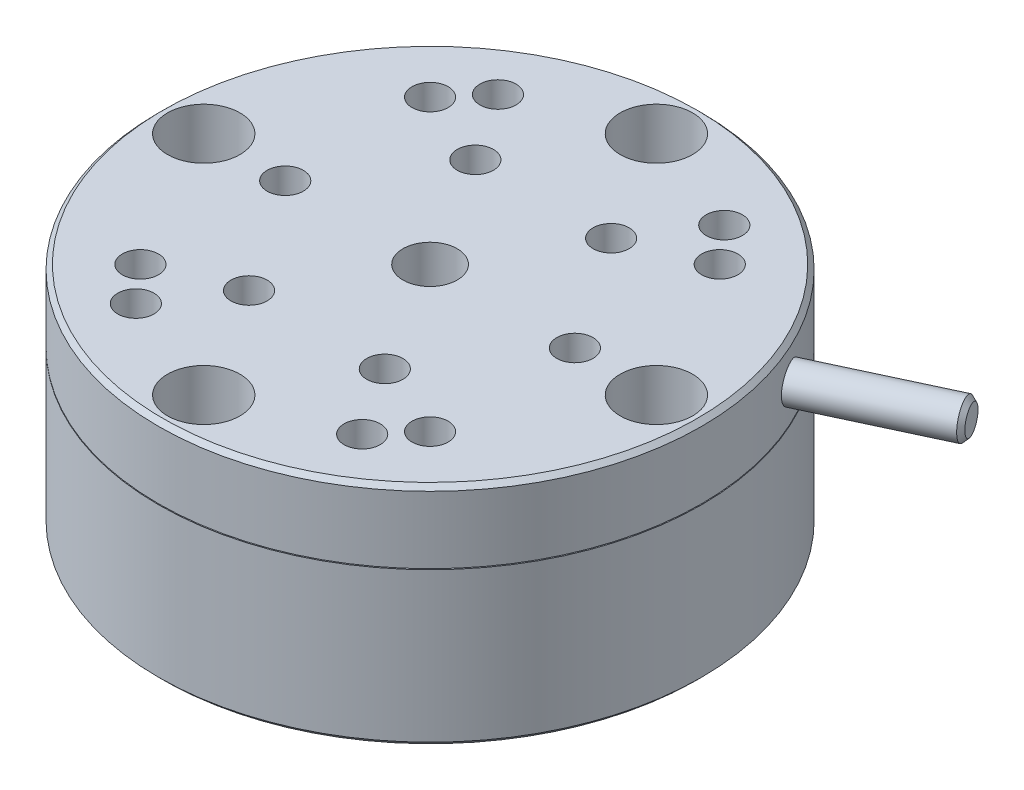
ISO-10303-21;
HEADER;
FILE_DESCRIPTION(('STEP AP214'),'2;1');
FILE_NAME('part.step','',(''),(''),'','','');
FILE_SCHEMA(('AUTOMOTIVE_DESIGN { 1 0 10303 214 1 1 1 1 }'));
ENDSEC;
DATA;
#1=APPLICATION_CONTEXT('core data for automotive mechanical design processes');
#2=APPLICATION_PROTOCOL_DEFINITION('international standard','automotive_design',2000,#1);
#3=PRODUCT_CONTEXT('',#1,'mechanical');
#4=PRODUCT('Part','Part','',(#3));
#5=PRODUCT_RELATED_PRODUCT_CATEGORY('part','',(#4));
#6=PRODUCT_DEFINITION_FORMATION('','',#4);
#7=PRODUCT_DEFINITION_CONTEXT('part definition',#1,'design');
#8=PRODUCT_DEFINITION('design','',#6,#7);
#9=PRODUCT_DEFINITION_SHAPE('','',#8);
#10=(LENGTH_UNIT() NAMED_UNIT(*) SI_UNIT(.MILLI.,.METRE.));
#11=(NAMED_UNIT(*) PLANE_ANGLE_UNIT() SI_UNIT($,.RADIAN.));
#12=(NAMED_UNIT(*) SI_UNIT($,.STERADIAN.) SOLID_ANGLE_UNIT());
#13=UNCERTAINTY_MEASURE_WITH_UNIT(LENGTH_MEASURE(1.E-05),#10,'distance_accuracy_value','');
#14=(GEOMETRIC_REPRESENTATION_CONTEXT(3) GLOBAL_UNCERTAINTY_ASSIGNED_CONTEXT((#13)) GLOBAL_UNIT_ASSIGNED_CONTEXT((#10,
#11,#12)) REPRESENTATION_CONTEXT('',''));
#15=CARTESIAN_POINT('',(0.,0.,0.));
#16=DIRECTION('',(0.,0.,1.));
#17=DIRECTION('',(1.,0.,0.));
#18=AXIS2_PLACEMENT_3D('',#15,#16,#17);
#19=CARTESIAN_POINT('',(-29.5,25.,0.));
#20=DIRECTION('',(0.,-1.,0.));
#21=DIRECTION('',(0.,0.,-1.));
#22=AXIS2_PLACEMENT_3D('',#19,#20,#21);
#23=PLANE('',#22);
#24=CARTESIAN_POINT('',(0.,25.,0.));
#25=DIRECTION('',(0.,1.,0.));
#26=DIRECTION('',(0.,0.,1.));
#27=AXIS2_PLACEMENT_3D('',#24,#25,#26);
#28=CIRCLE('',#27,3.);
#29=CARTESIAN_POINT('',(0.,25.,3.));
#30=VERTEX_POINT('',#29);
#31=EDGE_CURVE('E100',#30,#30,#28,.T.);
#32=ORIENTED_EDGE('',*,*,#31,.F.);
#33=EDGE_LOOP('',(#32));
#34=FACE_BOUND('',#33,.T.);
#35=CARTESIAN_POINT('',(-16.,25.,16.));
#36=DIRECTION('',(0.,1.,0.));
#37=DIRECTION('',(0.,0.,1.));
#38=AXIS2_PLACEMENT_3D('',#35,#36,#37);
#39=CIRCLE('',#38,2.);
#40=CARTESIAN_POINT('',(-16.,25.,18.));
#41=VERTEX_POINT('',#40);
#42=EDGE_CURVE('E108',#41,#41,#39,.T.);
#43=ORIENTED_EDGE('',*,*,#42,.F.);
#44=EDGE_LOOP('',(#43));
#45=FACE_BOUND('',#44,.T.);
#46=CARTESIAN_POINT('',(16.,25.,16.));
#47=DIRECTION('',(0.,1.,0.));
#48=DIRECTION('',(0.,0.,1.));
#49=AXIS2_PLACEMENT_3D('',#46,#47,#48);
#50=CIRCLE('',#49,2.);
#51=CARTESIAN_POINT('',(16.,25.,18.));
#52=VERTEX_POINT('',#51);
#53=EDGE_CURVE('E114',#52,#52,#50,.T.);
#54=ORIENTED_EDGE('',*,*,#53,.F.);
#55=EDGE_LOOP('',(#54));
#56=FACE_BOUND('',#55,.T.);
#57=CARTESIAN_POINT('',(16.,25.,-16.));
#58=DIRECTION('',(0.,1.,0.));
#59=DIRECTION('',(0.,0.,1.));
#60=AXIS2_PLACEMENT_3D('',#57,#58,#59);
#61=CIRCLE('',#60,2.);
#62=CARTESIAN_POINT('',(16.,25.,-14.));
#63=VERTEX_POINT('',#62);
#64=EDGE_CURVE('E120',#63,#63,#61,.T.);
#65=ORIENTED_EDGE('',*,*,#64,.F.);
#66=EDGE_LOOP('',(#65));
#67=FACE_BOUND('',#66,.T.);
#68=CARTESIAN_POINT('',(-16.,25.,-16.));
#69=DIRECTION('',(0.,1.,0.));
#70=DIRECTION('',(0.,0.,1.));
#71=AXIS2_PLACEMENT_3D('',#68,#69,#70);
#72=CIRCLE('',#71,2.);
#73=CARTESIAN_POINT('',(-16.,25.,-14.));
#74=VERTEX_POINT('',#73);
#75=EDGE_CURVE('E126',#74,#74,#72,.T.);
#76=ORIENTED_EDGE('',*,*,#75,.F.);
#77=EDGE_LOOP('',(#76));
#78=FACE_BOUND('',#77,.T.);
#79=CARTESIAN_POINT('',(12.5,25.,-20.));
#80=DIRECTION('',(0.,1.,0.));
#81=DIRECTION('',(0.,0.,1.));
#82=AXIS2_PLACEMENT_3D('',#79,#80,#81);
#83=CIRCLE('',#82,2.);
#84=CARTESIAN_POINT('',(12.5,25.,-18.));
#85=VERTEX_POINT('',#84);
#86=EDGE_CURVE('E132',#85,#85,#83,.T.);
#87=ORIENTED_EDGE('',*,*,#86,.F.);
#88=EDGE_LOOP('',(#87));
#89=FACE_BOUND('',#88,.T.);
#90=CARTESIAN_POINT('',(-12.5,25.,-20.));
#91=DIRECTION('',(0.,1.,0.));
#92=DIRECTION('',(0.,0.,1.));
#93=AXIS2_PLACEMENT_3D('',#90,#91,#92);
#94=CIRCLE('',#93,2.);
#95=CARTESIAN_POINT('',(-12.5,25.,-18.));
#96=VERTEX_POINT('',#95);
#97=EDGE_CURVE('E138',#96,#96,#94,.T.);
#98=ORIENTED_EDGE('',*,*,#97,.F.);
#99=EDGE_LOOP('',(#98));
#100=FACE_BOUND('',#99,.T.);
#101=CARTESIAN_POINT('',(12.5,25.,20.));
#102=DIRECTION('',(0.,1.,0.));
#103=DIRECTION('',(0.,0.,1.));
#104=AXIS2_PLACEMENT_3D('',#101,#102,#103);
#105=CIRCLE('',#104,2.);
#106=CARTESIAN_POINT('',(12.5,25.,22.));
#107=VERTEX_POINT('',#106);
#108=EDGE_CURVE('E144',#107,#107,#105,.T.);
#109=ORIENTED_EDGE('',*,*,#108,.F.);
#110=EDGE_LOOP('',(#109));
#111=FACE_BOUND('',#110,.T.);
#112=CARTESIAN_POINT('',(-12.5,25.,20.));
#113=DIRECTION('',(0.,1.,0.));
#114=DIRECTION('',(0.,0.,1.));
#115=AXIS2_PLACEMENT_3D('',#112,#113,#114);
#116=CIRCLE('',#115,2.);
#117=CARTESIAN_POINT('',(-12.5,25.,22.));
#118=VERTEX_POINT('',#117);
#119=EDGE_CURVE('E150',#118,#118,#116,.T.);
#120=ORIENTED_EDGE('',*,*,#119,.F.);
#121=EDGE_LOOP('',(#120));
#122=FACE_BOUND('',#121,.T.);
#123=CARTESIAN_POINT('',(16.,25.,0.));
#124=DIRECTION('',(0.,1.,0.));
#125=DIRECTION('',(0.,0.,1.));
#126=AXIS2_PLACEMENT_3D('',#123,#124,#125);
#127=CIRCLE('',#126,2.);
#128=CARTESIAN_POINT('',(16.,25.,2.));
#129=VERTEX_POINT('',#128);
#130=EDGE_CURVE('E156',#129,#129,#127,.T.);
#131=ORIENTED_EDGE('',*,*,#130,.F.);
#132=EDGE_LOOP('',(#131));
#133=FACE_BOUND('',#132,.T.);
#134=CARTESIAN_POINT('',(-16.,25.,0.));
#135=DIRECTION('',(0.,1.,0.));
#136=DIRECTION('',(0.,0.,1.));
#137=AXIS2_PLACEMENT_3D('',#134,#135,#136);
#138=CIRCLE('',#137,2.);
#139=CARTESIAN_POINT('',(-16.,25.,2.));
#140=VERTEX_POINT('',#139);
#141=EDGE_CURVE('E162',#140,#140,#138,.T.);
#142=ORIENTED_EDGE('',*,*,#141,.F.);
#143=EDGE_LOOP('',(#142));
#144=FACE_BOUND('',#143,.T.);
#145=CARTESIAN_POINT('',(7.5,25.,-12.5));
#146=DIRECTION('',(0.,1.,0.));
#147=DIRECTION('',(0.,0.,1.));
#148=AXIS2_PLACEMENT_3D('',#145,#146,#147);
#149=CIRCLE('',#148,2.);
#150=CARTESIAN_POINT('',(7.5,25.,-10.5));
#151=VERTEX_POINT('',#150);
#152=EDGE_CURVE('E168',#151,#151,#149,.T.);
#153=ORIENTED_EDGE('',*,*,#152,.F.);
#154=EDGE_LOOP('',(#153));
#155=FACE_BOUND('',#154,.T.);
#156=CARTESIAN_POINT('',(-7.5,25.,-12.5));
#157=DIRECTION('',(0.,1.,0.));
#158=DIRECTION('',(0.,0.,1.));
#159=AXIS2_PLACEMENT_3D('',#156,#157,#158);
#160=CIRCLE('',#159,2.);
#161=CARTESIAN_POINT('',(-7.5,25.,-10.5));
#162=VERTEX_POINT('',#161);
#163=EDGE_CURVE('E174',#162,#162,#160,.T.);
#164=ORIENTED_EDGE('',*,*,#163,.F.);
#165=EDGE_LOOP('',(#164));
#166=FACE_BOUND('',#165,.T.);
#167=CARTESIAN_POINT('',(-7.5,25.,12.5));
#168=DIRECTION('',(0.,1.,0.));
#169=DIRECTION('',(0.,0.,1.));
#170=AXIS2_PLACEMENT_3D('',#167,#168,#169);
#171=CIRCLE('',#170,2.);
#172=CARTESIAN_POINT('',(-7.5,25.,14.5));
#173=VERTEX_POINT('',#172);
#174=EDGE_CURVE('E180',#173,#173,#171,.T.);
#175=ORIENTED_EDGE('',*,*,#174,.F.);
#176=EDGE_LOOP('',(#175));
#177=FACE_BOUND('',#176,.T.);
#178=CARTESIAN_POINT('',(7.5,25.,12.5));
#179=DIRECTION('',(0.,1.,0.));
#180=DIRECTION('',(0.,0.,1.));
#181=AXIS2_PLACEMENT_3D('',#178,#179,#180);
#182=CIRCLE('',#181,2.);
#183=CARTESIAN_POINT('',(7.5,25.,14.5));
#184=VERTEX_POINT('',#183);
#185=EDGE_CURVE('E186',#184,#184,#182,.T.);
#186=ORIENTED_EDGE('',*,*,#185,.F.);
#187=EDGE_LOOP('',(#186));
#188=FACE_BOUND('',#187,.T.);
#189=CARTESIAN_POINT('',(0.,25.,-25.));
#190=DIRECTION('',(0.,1.,0.));
#191=DIRECTION('',(0.,0.,1.));
#192=AXIS2_PLACEMENT_3D('',#189,#190,#191);
#193=CIRCLE('',#192,3.99999999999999);
#194=CARTESIAN_POINT('',(0.,25.,-21.));
#195=VERTEX_POINT('',#194);
#196=EDGE_CURVE('E226',#195,#195,#193,.T.);
#197=ORIENTED_EDGE('',*,*,#196,.F.);
#198=EDGE_LOOP('',(#197));
#199=FACE_BOUND('',#198,.T.);
#200=CARTESIAN_POINT('',(0.,25.,25.));
#201=DIRECTION('',(0.,1.,0.));
#202=DIRECTION('',(0.,0.,1.));
#203=AXIS2_PLACEMENT_3D('',#200,#201,#202);
#204=CIRCLE('',#203,3.99999999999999);
#205=CARTESIAN_POINT('',(0.,25.,29.));
#206=VERTEX_POINT('',#205);
#207=EDGE_CURVE('E238',#206,#206,#204,.T.);
#208=ORIENTED_EDGE('',*,*,#207,.F.);
#209=EDGE_LOOP('',(#208));
#210=FACE_BOUND('',#209,.T.);
#211=CARTESIAN_POINT('',(-25.,25.,0.));
#212=DIRECTION('',(0.,1.,0.));
#213=DIRECTION('',(0.,0.,1.));
#214=AXIS2_PLACEMENT_3D('',#211,#212,#213);
#215=CIRCLE('',#214,3.99999999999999);
#216=CARTESIAN_POINT('',(-25.,25.,3.99999999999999));
#217=VERTEX_POINT('',#216);
#218=EDGE_CURVE('E250',#217,#217,#215,.T.);
#219=ORIENTED_EDGE('',*,*,#218,.F.);
#220=EDGE_LOOP('',(#219));
#221=FACE_BOUND('',#220,.T.);
#222=CARTESIAN_POINT('',(25.,25.,0.));
#223=DIRECTION('',(0.,1.,0.));
#224=DIRECTION('',(0.,0.,1.));
#225=AXIS2_PLACEMENT_3D('',#222,#223,#224);
#226=CIRCLE('',#225,3.99999999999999);
#227=CARTESIAN_POINT('',(25.,25.,3.99999999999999));
#228=VERTEX_POINT('',#227);
#229=EDGE_CURVE('E262',#228,#228,#226,.T.);
#230=ORIENTED_EDGE('',*,*,#229,.F.);
#231=EDGE_LOOP('',(#230));
#232=FACE_BOUND('',#231,.T.);
#233=CARTESIAN_POINT('',(0.,25.,0.));
#234=DIRECTION('',(0.,-1.,0.));
#235=DIRECTION('',(0.,0.,-1.));
#236=AXIS2_PLACEMENT_3D('',#233,#234,#235);
#237=CIRCLE('',#236,29.5);
#238=CARTESIAN_POINT('',(0.,25.,-29.5));
#239=VERTEX_POINT('',#238);
#240=EDGE_CURVE('E11',#239,#239,#237,.T.);
#241=ORIENTED_EDGE('',*,*,#240,.F.);
#242=EDGE_LOOP('',(#241));
#243=FACE_BOUND('',#242,.T.);
#244=ADVANCED_FACE('F32',(#34,#45,#56,#67,#78,#89,#100,#111,#122,#133,#144,#155,#166,#177,#188,
#199,#210,#221,#232,#243),#23,.F.);
#245=CARTESIAN_POINT('',(0.,25.,0.));
#246=DIRECTION('',(0.,-1.,0.));
#247=DIRECTION('',(0.,0.,-1.));
#248=AXIS2_PLACEMENT_3D('',#245,#246,#247);
#249=CONICAL_SURFACE('',#248,29.5,0.785398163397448);
#250=CARTESIAN_POINT('',(0.,24.5,0.));
#251=DIRECTION('',(0.,-1.,0.));
#252=DIRECTION('',(0.,0.,-1.));
#253=AXIS2_PLACEMENT_3D('',#250,#251,#252);
#254=CIRCLE('',#253,30.);
#255=CARTESIAN_POINT('',(0.,24.5,-30.));
#256=VERTEX_POINT('',#255);
#257=EDGE_CURVE('E44',#256,#256,#254,.T.);
#258=ORIENTED_EDGE('',*,*,#257,.F.);
#259=EDGE_LOOP('',(#258));
#260=FACE_BOUND('',#259,.T.);
#261=ORIENTED_EDGE('',*,*,#240,.T.);
#262=EDGE_LOOP('',(#261));
#263=FACE_BOUND('',#262,.T.);
#264=ADVANCED_FACE('F375',(#260,#263),#249,.T.);
#265=CARTESIAN_POINT('',(0.,-48.2183852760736,0.));
#266=DIRECTION('',(0.,-1.,0.));
#267=DIRECTION('',(0.,0.,-1.));
#268=AXIS2_PLACEMENT_3D('',#265,#266,#267);
#269=CYLINDRICAL_SURFACE('',#268,30.);
#270=CARTESIAN_POINT('',(27.9739823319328,21.,-10.8377263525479));
#271=CARTESIAN_POINT('',(27.9739810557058,21.1122068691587,-10.8377311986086));
#272=CARTESIAN_POINT('',(27.9705561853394,21.22449192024,-10.8465826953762));
#273=CARTESIAN_POINT('',(27.9568955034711,21.4459604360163,-10.8817432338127));
#274=CARTESIAN_POINT('',(27.946651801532,21.5551401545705,-10.9080724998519));
#275=CARTESIAN_POINT('',(27.9195075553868,21.7671580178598,-10.9773618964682));
#276=CARTESIAN_POINT('',(27.9026105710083,21.8699995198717,-11.0203131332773));
#277=CARTESIAN_POINT('',(27.8624286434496,22.0664636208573,-11.1215115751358));
#278=CARTESIAN_POINT('',(27.8391451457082,22.1600882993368,-11.1797553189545));
#279=CARTESIAN_POINT('',(27.7865399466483,22.3356459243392,-11.3098680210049));
#280=CARTESIAN_POINT('',(27.757209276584,22.4175611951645,-11.3817572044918));
#281=CARTESIAN_POINT('',(27.6930679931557,22.5672233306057,-11.5369415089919));
#282=CARTESIAN_POINT('',(27.6582571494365,22.6349695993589,-11.6202371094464));
#283=CARTESIAN_POINT('',(27.5838253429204,22.7544258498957,-11.7958326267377));
#284=CARTESIAN_POINT('',(27.5442000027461,22.8061210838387,-11.8881407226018));
#285=CARTESIAN_POINT('',(27.461050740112,22.891913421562,-12.0789698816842));
#286=CARTESIAN_POINT('',(27.417526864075,22.9260107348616,-12.1774908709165));
#287=CARTESIAN_POINT('',(27.3277184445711,22.9755899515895,-12.3777146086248));
#288=CARTESIAN_POINT('',(27.281438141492,22.9910997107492,-12.4794123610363));
#289=CARTESIAN_POINT('',(27.1872962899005,23.0031495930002,-12.6831981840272));
#290=CARTESIAN_POINT('',(27.1394347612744,22.9996899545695,-12.7852862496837));
#291=CARTESIAN_POINT('',(27.0435879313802,22.9739221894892,-12.9867926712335));
#292=CARTESIAN_POINT('',(26.9956029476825,22.9516440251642,-13.0862150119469));
#293=CARTESIAN_POINT('',(26.900904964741,22.8889181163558,-13.2797940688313));
#294=CARTESIAN_POINT('',(26.8541919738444,22.848470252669,-13.3739507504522));
#295=CARTESIAN_POINT('',(26.7635144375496,22.7505192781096,-13.5545018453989));
#296=CARTESIAN_POINT('',(26.7195521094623,22.6930026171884,-13.6408900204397));
#297=CARTESIAN_POINT('',(26.6359084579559,22.5625565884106,-13.8035051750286));
#298=CARTESIAN_POINT('',(26.5962271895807,22.4896270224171,-13.8797320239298));
#299=CARTESIAN_POINT('',(26.5224761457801,22.3302562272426,-14.0201489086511));
#300=CARTESIAN_POINT('',(26.4884174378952,22.2437889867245,-14.0843152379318));
#301=CARTESIAN_POINT('',(26.4272568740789,22.0598883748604,-14.1987435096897));
#302=CARTESIAN_POINT('',(26.4001550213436,21.9624549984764,-14.2490054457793));
#303=CARTESIAN_POINT('',(26.353932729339,21.7593709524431,-14.3343153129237));
#304=CARTESIAN_POINT('',(26.3348128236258,21.653719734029,-14.3693622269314));
#305=CARTESIAN_POINT('',(26.3052990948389,21.4372068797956,-14.4233211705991));
#306=CARTESIAN_POINT('',(26.2949051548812,21.3263453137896,-14.4422334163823));
#307=CARTESIAN_POINT('',(26.2832638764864,21.1027870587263,-14.4634086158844));
#308=CARTESIAN_POINT('',(26.2819989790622,20.9900943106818,-14.4657035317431));
#309=CARTESIAN_POINT('',(26.2886192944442,20.7658719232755,-14.4536687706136));
#310=CARTESIAN_POINT('',(26.296504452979,20.6543422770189,-14.4393391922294));
#311=CARTESIAN_POINT('',(26.3211029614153,20.4357151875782,-14.3944498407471));
#312=CARTESIAN_POINT('',(26.3378082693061,20.3286138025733,-14.3639048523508));
#313=CARTESIAN_POINT('',(26.3793944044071,20.1217617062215,-14.2873873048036));
#314=CARTESIAN_POINT('',(26.4042753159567,20.0220110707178,-14.2414145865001));
#315=CARTESIAN_POINT('',(26.4613124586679,19.832524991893,-14.1351537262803));
#316=CARTESIAN_POINT('',(26.4934797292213,19.7428050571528,-14.0748438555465));
#317=CARTESIAN_POINT('',(26.5638788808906,19.5760835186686,-13.9415209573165));
#318=CARTESIAN_POINT('',(26.6021108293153,19.4990820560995,-13.8685077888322));
#319=CARTESIAN_POINT('',(26.6833369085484,19.3598601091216,-13.7115766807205));
#320=CARTESIAN_POINT('',(26.7263384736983,19.2976631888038,-13.6276416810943));
#321=CARTESIAN_POINT('',(26.8155701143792,19.1899771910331,-13.4512066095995));
#322=CARTESIAN_POINT('',(26.8618001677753,19.1444879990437,-13.3587065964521));
#323=CARTESIAN_POINT('',(26.9559236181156,19.0715496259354,-13.1677444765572));
#324=CARTESIAN_POINT('',(27.003815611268,19.0440855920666,-13.0692873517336));
#325=CARTESIAN_POINT('',(27.099799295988,19.0079285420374,-12.8690790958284));
#326=CARTESIAN_POINT('',(27.1478909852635,18.9992353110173,-12.7673280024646));
#327=CARTESIAN_POINT('',(27.2427658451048,19.0008687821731,-12.5636105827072));
#328=CARTESIAN_POINT('',(27.2895513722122,19.0111586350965,-12.4616450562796));
#329=CARTESIAN_POINT('',(27.3806349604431,19.0503897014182,-12.2602223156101));
#330=CARTESIAN_POINT('',(27.424933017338,19.0793309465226,-12.1607651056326));
#331=CARTESIAN_POINT('',(27.5099297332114,19.1550347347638,-11.9672446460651));
#332=CARTESIAN_POINT('',(27.550628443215,19.2017970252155,-11.8731813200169));
#333=CARTESIAN_POINT('',(27.6274965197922,19.3118106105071,-11.6932041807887));
#334=CARTESIAN_POINT('',(27.6636659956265,19.3750615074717,-11.6072901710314));
#335=CARTESIAN_POINT('',(27.7307894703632,19.5163937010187,-11.4460025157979));
#336=CARTESIAN_POINT('',(27.7617338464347,19.5945018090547,-11.3706483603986));
#337=CARTESIAN_POINT('',(27.8177504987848,19.7632919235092,-11.2329115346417));
#338=CARTESIAN_POINT('',(27.8428213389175,19.8539769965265,-11.1705320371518));
#339=CARTESIAN_POINT('',(27.8866782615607,20.0454630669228,-11.0605919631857));
#340=CARTESIAN_POINT('',(27.9054558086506,20.1462775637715,-11.0130515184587));
#341=CARTESIAN_POINT('',(27.936362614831,20.3549901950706,-10.934415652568));
#342=CARTESIAN_POINT('',(27.9484996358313,20.462879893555,-10.9033010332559));
#343=CARTESIAN_POINT('',(27.9628071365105,20.6428546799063,-10.8665374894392));
#344=CARTESIAN_POINT('',(27.9669946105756,20.7137773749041,-10.8557483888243));
#345=CARTESIAN_POINT('',(27.9725826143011,20.8564560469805,-10.8413412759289));
#346=CARTESIAN_POINT('',(27.9739831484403,20.9282120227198,-10.8377232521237));
#347=CARTESIAN_POINT('',(27.9739823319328,21.,-10.8377263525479));
#348=B_SPLINE_CURVE_WITH_KNOTS('',3,(#270,#271,#272,#273,#274,#275,#276,#277,#278,#279,#280,
#281,#282,#283,#284,#285,#286,#287,#288,#289,#290,#291,#292,#293,#294,#295,#296,#297,#298,#299,
#300,#301,#302,#303,#304,#305,#306,#307,#308,#309,#310,#311,#312,#313,#314,#315,#316,#317,#318,
#319,#320,#321,#322,#323,#324,#325,#326,#327,#328,#329,#330,#331,#332,#333,#334,#335,#336,#337,
#338,#339,#340,#341,#342,#343,#344,#345,#346,#347),.UNSPECIFIED.,.T.,.F.,(4,2,2,2,2,2,2,2,2,2,2,
2,2,2,2,2,2,2,2,2,2,2,2,2,2,2,2,2,2,2,2,2,2,2,2,2,2,2,4),(0.,0.33635852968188,0.673106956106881,
1.00967545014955,1.34616783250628,1.68316291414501,2.02017216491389,2.35749015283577,
2.69480412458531,3.03161195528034,3.36841555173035,3.70468390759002,4.04095446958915,
4.37749269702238,4.71403525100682,5.05123255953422,5.38843002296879,5.72565002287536,
6.06286550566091,6.39943220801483,6.73599691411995,7.07225527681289,7.40851710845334,
7.74529185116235,8.08207033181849,8.41938132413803,8.75669000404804,9.09372039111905,
9.43074692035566,9.7671199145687,10.1034934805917,10.4398622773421,10.7762229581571,
11.1131964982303,11.4502523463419,11.7877635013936,12.1248793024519,12.3400759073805,
12.5552721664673),.UNSPECIFIED.);
#349=CARTESIAN_POINT('',(27.9739823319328,21.,-10.8377263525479));
#350=VERTEX_POINT('',#349);
#351=EDGE_CURVE('E35',#350,#350,#348,.T.);
#352=ORIENTED_EDGE('',*,*,#351,.T.);
#353=EDGE_LOOP('',(#352));
#354=FACE_BOUND('',#353,.T.);
#355=CARTESIAN_POINT('',(0.,17.1,0.));
#356=DIRECTION('',(0.,-1.,0.));
#357=DIRECTION('',(0.,0.,-1.));
#358=AXIS2_PLACEMENT_3D('',#355,#356,#357);
#359=CIRCLE('',#358,30.);
#360=CARTESIAN_POINT('',(0.,17.1,-30.));
#361=VERTEX_POINT('',#360);
#362=EDGE_CURVE('E280',#361,#361,#359,.T.);
#363=ORIENTED_EDGE('',*,*,#362,.F.);
#364=EDGE_LOOP('',(#363));
#365=FACE_BOUND('',#364,.T.);
#366=ORIENTED_EDGE('',*,*,#257,.T.);
#367=EDGE_LOOP('',(#366));
#368=FACE_BOUND('',#367,.T.);
#369=ADVANCED_FACE('F380',(#354,#365,#368),#269,.T.);
#370=CARTESIAN_POINT('',(-30.,17.1,0.));
#371=DIRECTION('',(0.,1.,0.));
#372=DIRECTION('',(0.,0.,1.));
#373=AXIS2_PLACEMENT_3D('',#370,#371,#372);
#374=PLANE('',#373);
#375=CARTESIAN_POINT('',(0.,17.1,0.));
#376=DIRECTION('',(0.,-1.,0.));
#377=DIRECTION('',(0.,0.,-1.));
#378=AXIS2_PLACEMENT_3D('',#375,#376,#377);
#379=CIRCLE('',#378,29.5);
#380=CARTESIAN_POINT('',(0.,17.1,-29.5));
#381=VERTEX_POINT('',#380);
#382=EDGE_CURVE('E277',#381,#381,#379,.T.);
#383=ORIENTED_EDGE('',*,*,#382,.F.);
#384=EDGE_LOOP('',(#383));
#385=FACE_BOUND('',#384,.T.);
#386=ORIENTED_EDGE('',*,*,#362,.T.);
#387=EDGE_LOOP('',(#386));
#388=FACE_BOUND('',#387,.T.);
#389=ADVANCED_FACE('F495',(#385,#388),#374,.F.);
#390=CARTESIAN_POINT('',(0.,-48.2183852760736,0.));
#391=DIRECTION('',(0.,-1.,0.));
#392=DIRECTION('',(0.,0.,-1.));
#393=AXIS2_PLACEMENT_3D('',#390,#391,#392);
#394=CYLINDRICAL_SURFACE('',#393,29.5);
#395=CARTESIAN_POINT('',(0.,17.,0.));
#396=DIRECTION('',(0.,-1.,0.));
#397=DIRECTION('',(0.,0.,-1.));
#398=AXIS2_PLACEMENT_3D('',#395,#396,#397);
#399=CIRCLE('',#398,29.5);
#400=CARTESIAN_POINT('',(0.,17.,-29.5));
#401=VERTEX_POINT('',#400);
#402=EDGE_CURVE('E274',#401,#401,#399,.T.);
#403=ORIENTED_EDGE('',*,*,#402,.F.);
#404=EDGE_LOOP('',(#403));
#405=FACE_BOUND('',#404,.T.);
#406=ORIENTED_EDGE('',*,*,#382,.T.);
#407=EDGE_LOOP('',(#406));
#408=FACE_BOUND('',#407,.T.);
#409=ADVANCED_FACE('F490',(#405,#408),#394,.T.);
#410=CARTESIAN_POINT('',(-29.5,17.,0.));
#411=DIRECTION('',(0.,-1.,0.));
#412=DIRECTION('',(0.,0.,-1.));
#413=AXIS2_PLACEMENT_3D('',#410,#411,#412);
#414=PLANE('',#413);
#415=CARTESIAN_POINT('',(0.,17.,0.));
#416=DIRECTION('',(0.,-1.,0.));
#417=DIRECTION('',(0.,0.,-1.));
#418=AXIS2_PLACEMENT_3D('',#415,#416,#417);
#419=CIRCLE('',#418,30.);
#420=CARTESIAN_POINT('',(0.,17.,-30.));
#421=VERTEX_POINT('',#420);
#422=EDGE_CURVE('E271',#421,#421,#419,.T.);
#423=ORIENTED_EDGE('',*,*,#422,.F.);
#424=EDGE_LOOP('',(#423));
#425=FACE_BOUND('',#424,.T.);
#426=ORIENTED_EDGE('',*,*,#402,.T.);
#427=EDGE_LOOP('',(#426));
#428=FACE_BOUND('',#427,.T.);
#429=ADVANCED_FACE('F370',(#425,#428),#414,.F.);
#430=CARTESIAN_POINT('',(0.,-48.2183852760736,0.));
#431=DIRECTION('',(0.,-1.,0.));
#432=DIRECTION('',(0.,0.,-1.));
#433=AXIS2_PLACEMENT_3D('',#430,#431,#432);
#434=CYLINDRICAL_SURFACE('',#433,30.);
#435=CARTESIAN_POINT('',(-22.2473305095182,10.,-20.1260101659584));
#436=CARTESIAN_POINT('',(-22.2473282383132,9.91580086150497,-20.1260131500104));
#437=CARTESIAN_POINT('',(-22.2425543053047,9.83154201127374,-20.1312936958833));
#438=CARTESIAN_POINT('',(-22.2235569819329,9.66534872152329,-20.1522630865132));
#439=CARTESIAN_POINT('',(-22.2093224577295,9.58341713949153,-20.1679641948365));
#440=CARTESIAN_POINT('',(-22.1717503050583,9.42430991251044,-20.2092618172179));
#441=CARTESIAN_POINT('',(-22.1484173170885,9.34713186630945,-20.2348532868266));
#442=CARTESIAN_POINT('',(-22.0932225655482,9.19969922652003,-20.2951023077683));
#443=CARTESIAN_POINT('',(-22.0613628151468,9.12944300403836,-20.3297577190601));
#444=CARTESIAN_POINT('',(-21.9898652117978,8.99775628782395,-20.4070721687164));
#445=CARTESIAN_POINT('',(-21.9502204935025,8.93633366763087,-20.4497382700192));
#446=CARTESIAN_POINT('',(-21.8641639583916,8.82412484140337,-20.5417207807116));
#447=CARTESIAN_POINT('',(-21.8177518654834,8.77333906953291,-20.5910374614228));
#448=CARTESIAN_POINT('',(-21.7193273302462,8.68382399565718,-20.6948285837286));
#449=CARTESIAN_POINT('',(-21.6673120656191,8.64510080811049,-20.7493056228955));
#450=CARTESIAN_POINT('',(-21.5590720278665,8.58084936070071,-20.8617472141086));
#451=CARTESIAN_POINT('',(-21.5028472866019,8.55532100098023,-20.9197117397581));
#452=CARTESIAN_POINT('',(-21.3877614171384,8.51820461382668,-21.0373578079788));
#453=CARTESIAN_POINT('',(-21.3289025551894,8.50660483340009,-21.0970378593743));
#454=CARTESIAN_POINT('',(-21.2101432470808,8.49763860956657,-21.2164302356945));
#455=CARTESIAN_POINT('',(-21.1502428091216,8.50027205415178,-21.2761425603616));
#456=CARTESIAN_POINT('',(-21.0311652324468,8.51968777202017,-21.3938564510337));
#457=CARTESIAN_POINT('',(-20.9719874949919,8.53645739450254,-21.4518594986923));
#458=CARTESIAN_POINT('',(-20.8560281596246,8.58364982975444,-21.5646153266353));
#459=CARTESIAN_POINT('',(-20.7992465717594,8.61407269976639,-21.6193680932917));
#460=CARTESIAN_POINT('',(-20.6897472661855,8.68772246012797,-21.7241826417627));
#461=CARTESIAN_POINT('',(-20.6370313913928,8.73095511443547,-21.7742422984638));
#462=CARTESIAN_POINT('',(-20.5372934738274,8.82899301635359,-21.8683397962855));
#463=CARTESIAN_POINT('',(-20.4902714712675,8.88379834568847,-21.9123775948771));
#464=CARTESIAN_POINT('',(-20.4033276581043,9.00349739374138,-21.9933572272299));
#465=CARTESIAN_POINT('',(-20.3634136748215,9.06840208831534,-22.0302912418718));
#466=CARTESIAN_POINT('',(-20.2920065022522,9.2064189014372,-22.0960819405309));
#467=CARTESIAN_POINT('',(-20.2605133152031,9.27953102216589,-22.124938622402));
#468=CARTESIAN_POINT('',(-20.2069537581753,9.43189397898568,-22.1738661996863));
#469=CARTESIAN_POINT('',(-20.1848876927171,9.51114501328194,-22.1939368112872));
#470=CARTESIAN_POINT('',(-20.1508985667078,9.6735331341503,-22.2248018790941));
#471=CARTESIAN_POINT('',(-20.1389754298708,9.7566701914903,-22.2355964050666));
#472=CARTESIAN_POINT('',(-20.1256685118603,9.92437402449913,-22.2476414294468));
#473=CARTESIAN_POINT('',(-20.1242733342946,10.008939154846,-22.2489022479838));
#474=CARTESIAN_POINT('',(-20.1320378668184,10.1771833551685,-22.2418766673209));
#475=CARTESIAN_POINT('',(-20.1411975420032,10.2608624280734,-22.2335902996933));
#476=CARTESIAN_POINT('',(-20.1697654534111,10.4249160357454,-22.2076772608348));
#477=CARTESIAN_POINT('',(-20.1891684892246,10.5052922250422,-22.1900553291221));
#478=CARTESIAN_POINT('',(-20.2375920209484,10.6605094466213,-22.1459011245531));
#479=CARTESIAN_POINT('',(-20.2666125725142,10.7353504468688,-22.1193688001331));
#480=CARTESIAN_POINT('',(-20.3333716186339,10.8774434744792,-22.0580155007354));
#481=CARTESIAN_POINT('',(-20.3711175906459,10.9446889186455,-22.0231874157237));
#482=CARTESIAN_POINT('',(-20.454121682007,11.0696157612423,-21.9461182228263));
#483=CARTESIAN_POINT('',(-20.4993798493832,11.1272970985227,-21.903877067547));
#484=CARTESIAN_POINT('',(-20.5960446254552,11.2315099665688,-21.8130085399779));
#485=CARTESIAN_POINT('',(-20.6474566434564,11.2780315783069,-21.7643755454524));
#486=CARTESIAN_POINT('',(-20.7548231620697,11.3585366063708,-21.6620130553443));
#487=CARTESIAN_POINT('',(-20.8107776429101,11.3925200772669,-21.6082835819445));
#488=CARTESIAN_POINT('',(-20.9255203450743,11.4469668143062,-21.4971850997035));
#489=CARTESIAN_POINT('',(-20.9843072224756,11.4674364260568,-21.4398178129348));
#490=CARTESIAN_POINT('',(-21.1030083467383,11.4942951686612,-21.3229915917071));
#491=CARTESIAN_POINT('',(-21.1629225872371,11.500684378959,-21.2635326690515));
#492=CARTESIAN_POINT('',(-21.2820888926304,11.4992001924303,-21.1442614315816));
#493=CARTESIAN_POINT('',(-21.3413416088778,11.4913423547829,-21.0844495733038));
#494=CARTESIAN_POINT('',(-21.4575926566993,11.4616192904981,-20.9661298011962));
#495=CARTESIAN_POINT('',(-21.5145909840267,11.439754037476,-20.9076218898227));
#496=CARTESIAN_POINT('',(-21.6247810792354,11.3826399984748,-20.7936320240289));
#497=CARTESIAN_POINT('',(-21.6779728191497,11.347391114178,-20.7381500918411));
#498=CARTESIAN_POINT('',(-21.779139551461,11.2645131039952,-20.6318799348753));
#499=CARTESIAN_POINT('',(-21.8271147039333,11.2168843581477,-20.5810915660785));
#500=CARTESIAN_POINT('',(-21.916658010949,11.1105429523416,-20.4857119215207));
#501=CARTESIAN_POINT('',(-21.9582198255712,11.0518194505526,-20.4411267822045));
#502=CARTESIAN_POINT('',(-22.0338407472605,10.9249625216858,-20.3595914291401));
#503=CARTESIAN_POINT('',(-22.0678980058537,10.8568267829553,-20.3226430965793));
#504=CARTESIAN_POINT('',(-22.1276807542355,10.7130258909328,-20.2575345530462));
#505=CARTESIAN_POINT('',(-22.1533982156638,10.6373535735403,-20.2293828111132));
#506=CARTESIAN_POINT('',(-22.1958037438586,10.4807356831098,-20.1828465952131));
#507=CARTESIAN_POINT('',(-22.2125024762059,10.3997964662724,-20.1644505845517));
#508=CARTESIAN_POINT('',(-22.2320901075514,10.2652953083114,-20.1428470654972));
#509=CARTESIAN_POINT('',(-22.2377988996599,10.2126045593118,-20.1365422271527));
#510=CARTESIAN_POINT('',(-22.2454198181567,10.106617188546,-20.1281228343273));
#511=CARTESIAN_POINT('',(-22.2473319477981,10.0533205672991,-20.1260082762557));
#512=CARTESIAN_POINT('',(-22.2473305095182,10.,-20.1260101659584));
#513=B_SPLINE_CURVE_WITH_KNOTS('',3,(#435,#436,#437,#438,#439,#440,#441,#442,#443,#444,#445,
#446,#447,#448,#449,#450,#451,#452,#453,#454,#455,#456,#457,#458,#459,#460,#461,#462,#463,#464,
#465,#466,#467,#468,#469,#470,#471,#472,#473,#474,#475,#476,#477,#478,#479,#480,#481,#482,#483,
#484,#485,#486,#487,#488,#489,#490,#491,#492,#493,#494,#495,#496,#497,#498,#499,#500,#501,#502,
#503,#504,#505,#506,#507,#508,#509,#510,#511,#512),.UNSPECIFIED.,.T.,.F.,(4,2,2,2,2,2,2,2,2,2,2,
2,2,2,2,2,2,2,2,2,2,2,2,2,2,2,2,2,2,2,2,2,2,2,2,2,2,2,4),(0.,0.252402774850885,
0.505103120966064,0.757674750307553,1.01018679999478,1.2629225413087,1.5156685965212,
1.76854255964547,2.02141460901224,2.27407313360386,2.52672966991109,2.77916033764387,
3.03159206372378,3.28413754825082,3.53668481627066,3.78950849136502,4.04233223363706,
4.29516414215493,4.5479941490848,4.80055043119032,5.05310587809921,5.30553322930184,
5.55796204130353,5.81060798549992,6.06325554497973,6.3161268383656,6.56899703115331,
6.82174840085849,7.0744983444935,7.32697242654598,7.57944698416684,7.83192339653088,
8.0843920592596,8.33710872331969,8.589887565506,8.84290902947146,9.0956306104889,
9.25546918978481,9.415307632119),.UNSPECIFIED.);
#514=CARTESIAN_POINT('',(-22.2473305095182,10.,-20.1260101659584));
#515=VERTEX_POINT('',#514);
#516=EDGE_CURVE('E216',#515,#515,#513,.T.);
#517=ORIENTED_EDGE('',*,*,#516,.T.);
#518=EDGE_LOOP('',(#517));
#519=FACE_BOUND('',#518,.T.);
#520=CARTESIAN_POINT('',(0.,0.499999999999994,0.));
#521=DIRECTION('',(0.,-1.,0.));
#522=DIRECTION('',(0.,0.,-1.));
#523=AXIS2_PLACEMENT_3D('',#520,#521,#522);
#524=CIRCLE('',#523,30.);
#525=CARTESIAN_POINT('',(0.,0.499999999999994,-30.));
#526=VERTEX_POINT('',#525);
#527=EDGE_CURVE('E268',#526,#526,#524,.T.);
#528=ORIENTED_EDGE('',*,*,#527,.F.);
#529=EDGE_LOOP('',(#528));
#530=FACE_BOUND('',#529,.T.);
#531=ORIENTED_EDGE('',*,*,#422,.T.);
#532=EDGE_LOOP('',(#531));
#533=FACE_BOUND('',#532,.T.);
#534=ADVANCED_FACE('F289',(#519,#530,#533),#434,.T.);
#535=CARTESIAN_POINT('',(0.,0.499999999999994,0.));
#536=DIRECTION('',(0.,1.,0.));
#537=DIRECTION('',(0.,0.,1.));
#538=AXIS2_PLACEMENT_3D('',#535,#536,#537);
#539=CONICAL_SURFACE('',#538,30.,0.785398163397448);
#540=CARTESIAN_POINT('',(0.,0.,0.));
#541=DIRECTION('',(0.,-1.,0.));
#542=DIRECTION('',(0.,0.,-1.));
#543=AXIS2_PLACEMENT_3D('',#540,#541,#542);
#544=CIRCLE('',#543,29.5);
#545=CARTESIAN_POINT('',(0.,0.,-29.5));
#546=VERTEX_POINT('',#545);
#547=EDGE_CURVE('E265',#546,#546,#544,.T.);
#548=ORIENTED_EDGE('',*,*,#547,.F.);
#549=EDGE_LOOP('',(#548));
#550=FACE_BOUND('',#549,.T.);
#551=ORIENTED_EDGE('',*,*,#527,.T.);
#552=EDGE_LOOP('',(#551));
#553=FACE_BOUND('',#552,.T.);
#554=ADVANCED_FACE('F363',(#550,#553),#539,.T.);
#555=CARTESIAN_POINT('',(0.,0.,0.));
#556=DIRECTION('',(0.,1.,0.));
#557=DIRECTION('',(0.,0.,1.));
#558=AXIS2_PLACEMENT_3D('',#555,#556,#557);
#559=PLANE('',#558);
#560=CARTESIAN_POINT('',(0.,0.,-25.));
#561=DIRECTION('',(0.,1.,0.));
#562=DIRECTION('',(0.,0.,1.));
#563=AXIS2_PLACEMENT_3D('',#560,#561,#562);
#564=CIRCLE('',#563,2.24999999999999);
#565=CARTESIAN_POINT('',(0.,0.,-22.75));
#566=VERTEX_POINT('',#565);
#567=EDGE_CURVE('E217',#566,#566,#564,.T.);
#568=ORIENTED_EDGE('',*,*,#567,.T.);
#569=EDGE_LOOP('',(#568));
#570=FACE_BOUND('',#569,.T.);
#571=CARTESIAN_POINT('',(0.,0.,25.));
#572=DIRECTION('',(0.,1.,0.));
#573=DIRECTION('',(0.,0.,1.));
#574=AXIS2_PLACEMENT_3D('',#571,#572,#573);
#575=CIRCLE('',#574,2.24999999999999);
#576=CARTESIAN_POINT('',(0.,0.,27.25));
#577=VERTEX_POINT('',#576);
#578=EDGE_CURVE('E229',#577,#577,#575,.T.);
#579=ORIENTED_EDGE('',*,*,#578,.T.);
#580=EDGE_LOOP('',(#579));
#581=FACE_BOUND('',#580,.T.);
#582=CARTESIAN_POINT('',(-25.,0.,0.));
#583=DIRECTION('',(0.,1.,0.));
#584=DIRECTION('',(0.,0.,1.));
#585=AXIS2_PLACEMENT_3D('',#582,#583,#584);
#586=CIRCLE('',#585,2.25);
#587=CARTESIAN_POINT('',(-25.,0.,2.25));
#588=VERTEX_POINT('',#587);
#589=EDGE_CURVE('E241',#588,#588,#586,.T.);
#590=ORIENTED_EDGE('',*,*,#589,.T.);
#591=EDGE_LOOP('',(#590));
#592=FACE_BOUND('',#591,.T.);
#593=CARTESIAN_POINT('',(25.,0.,0.));
#594=DIRECTION('',(0.,1.,0.));
#595=DIRECTION('',(0.,0.,1.));
#596=AXIS2_PLACEMENT_3D('',#593,#594,#595);
#597=CIRCLE('',#596,2.25);
#598=CARTESIAN_POINT('',(25.,0.,2.25));
#599=VERTEX_POINT('',#598);
#600=EDGE_CURVE('E253',#599,#599,#597,.T.);
#601=ORIENTED_EDGE('',*,*,#600,.T.);
#602=EDGE_LOOP('',(#601));
#603=FACE_BOUND('',#602,.T.);
#604=ORIENTED_EDGE('',*,*,#547,.T.);
#605=EDGE_LOOP('',(#604));
#606=FACE_BOUND('',#605,.T.);
#607=ADVANCED_FACE('F360',(#570,#581,#592,#603,#606),#559,.F.);
#608=CARTESIAN_POINT('',(25.,25.,0.));
#609=DIRECTION('',(0.,1.,0.));
#610=DIRECTION('',(0.,0.,1.));
#611=AXIS2_PLACEMENT_3D('',#608,#609,#610);
#612=CYLINDRICAL_SURFACE('',#611,3.99999999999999);
#613=CARTESIAN_POINT('',(25.,4.,0.));
#614=DIRECTION('',(0.,1.,0.));
#615=DIRECTION('',(0.,0.,1.));
#616=AXIS2_PLACEMENT_3D('',#613,#614,#615);
#617=CIRCLE('',#616,4.);
#618=CARTESIAN_POINT('',(25.,4.,4.));
#619=VERTEX_POINT('',#618);
#620=EDGE_CURVE('E259',#619,#619,#617,.T.);
#621=ORIENTED_EDGE('',*,*,#620,.F.);
#622=EDGE_LOOP('',(#621));
#623=FACE_BOUND('',#622,.T.);
#624=ORIENTED_EDGE('',*,*,#229,.T.);
#625=EDGE_LOOP('',(#624));
#626=FACE_BOUND('',#625,.T.);
#627=ADVANCED_FACE('F356',(#623,#626),#612,.F.);
#628=CARTESIAN_POINT('',(27.25,4.,0.));
#629=DIRECTION('',(0.,-1.,0.));
#630=DIRECTION('',(0.,0.,-1.));
#631=AXIS2_PLACEMENT_3D('',#628,#629,#630);
#632=PLANE('',#631);
#633=CARTESIAN_POINT('',(25.,4.,0.));
#634=DIRECTION('',(0.,1.,0.));
#635=DIRECTION('',(0.,0.,1.));
#636=AXIS2_PLACEMENT_3D('',#633,#634,#635);
#637=CIRCLE('',#636,2.25);
#638=CARTESIAN_POINT('',(25.,4.,2.25));
#639=VERTEX_POINT('',#638);
#640=EDGE_CURVE('E256',#639,#639,#637,.T.);
#641=ORIENTED_EDGE('',*,*,#640,.F.);
#642=EDGE_LOOP('',(#641));
#643=FACE_BOUND('',#642,.T.);
#644=ORIENTED_EDGE('',*,*,#620,.T.);
#645=EDGE_LOOP('',(#644));
#646=FACE_BOUND('',#645,.T.);
#647=ADVANCED_FACE('F352',(#643,#646),#632,.F.);
#648=CARTESIAN_POINT('',(25.,25.,0.));
#649=DIRECTION('',(0.,1.,0.));
#650=DIRECTION('',(0.,0.,1.));
#651=AXIS2_PLACEMENT_3D('',#648,#649,#650);
#652=CYLINDRICAL_SURFACE('',#651,2.25);
#653=ORIENTED_EDGE('',*,*,#600,.F.);
#654=EDGE_LOOP('',(#653));
#655=FACE_BOUND('',#654,.T.);
#656=ORIENTED_EDGE('',*,*,#640,.T.);
#657=EDGE_LOOP('',(#656));
#658=FACE_BOUND('',#657,.T.);
#659=ADVANCED_FACE('F348',(#655,#658),#652,.F.);
#660=CARTESIAN_POINT('',(-25.,25.,0.));
#661=DIRECTION('',(0.,1.,0.));
#662=DIRECTION('',(0.,0.,1.));
#663=AXIS2_PLACEMENT_3D('',#660,#661,#662);
#664=CYLINDRICAL_SURFACE('',#663,3.99999999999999);
#665=CARTESIAN_POINT('',(-25.,4.,0.));
#666=DIRECTION('',(0.,1.,0.));
#667=DIRECTION('',(0.,0.,1.));
#668=AXIS2_PLACEMENT_3D('',#665,#666,#667);
#669=CIRCLE('',#668,4.);
#670=CARTESIAN_POINT('',(-25.,4.,4.));
#671=VERTEX_POINT('',#670);
#672=EDGE_CURVE('E247',#671,#671,#669,.T.);
#673=ORIENTED_EDGE('',*,*,#672,.F.);
#674=EDGE_LOOP('',(#673));
#675=FACE_BOUND('',#674,.T.);
#676=ORIENTED_EDGE('',*,*,#218,.T.);
#677=EDGE_LOOP('',(#676));
#678=FACE_BOUND('',#677,.T.);
#679=ADVANCED_FACE('F344',(#675,#678),#664,.F.);
#680=CARTESIAN_POINT('',(-22.75,4.,0.));
#681=DIRECTION('',(0.,-1.,0.));
#682=DIRECTION('',(0.,0.,-1.));
#683=AXIS2_PLACEMENT_3D('',#680,#681,#682);
#684=PLANE('',#683);
#685=CARTESIAN_POINT('',(-25.,4.,0.));
#686=DIRECTION('',(0.,1.,0.));
#687=DIRECTION('',(0.,0.,1.));
#688=AXIS2_PLACEMENT_3D('',#685,#686,#687);
#689=CIRCLE('',#688,2.25);
#690=CARTESIAN_POINT('',(-25.,4.,2.25));
#691=VERTEX_POINT('',#690);
#692=EDGE_CURVE('E244',#691,#691,#689,.T.);
#693=ORIENTED_EDGE('',*,*,#692,.F.);
#694=EDGE_LOOP('',(#693));
#695=FACE_BOUND('',#694,.T.);
#696=ORIENTED_EDGE('',*,*,#672,.T.);
#697=EDGE_LOOP('',(#696));
#698=FACE_BOUND('',#697,.T.);
#699=ADVANCED_FACE('F340',(#695,#698),#684,.F.);
#700=CARTESIAN_POINT('',(-25.,25.,0.));
#701=DIRECTION('',(0.,1.,0.));
#702=DIRECTION('',(0.,0.,1.));
#703=AXIS2_PLACEMENT_3D('',#700,#701,#702);
#704=CYLINDRICAL_SURFACE('',#703,2.25);
#705=ORIENTED_EDGE('',*,*,#589,.F.);
#706=EDGE_LOOP('',(#705));
#707=FACE_BOUND('',#706,.T.);
#708=ORIENTED_EDGE('',*,*,#692,.T.);
#709=EDGE_LOOP('',(#708));
#710=FACE_BOUND('',#709,.T.);
#711=ADVANCED_FACE('F336',(#707,#710),#704,.F.);
#712=CARTESIAN_POINT('',(0.,25.,25.));
#713=DIRECTION('',(0.,1.,0.));
#714=DIRECTION('',(0.,0.,1.));
#715=AXIS2_PLACEMENT_3D('',#712,#713,#714);
#716=CYLINDRICAL_SURFACE('',#715,3.99999999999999);
#717=CARTESIAN_POINT('',(0.,4.,25.));
#718=DIRECTION('',(0.,1.,0.));
#719=DIRECTION('',(0.,0.,1.));
#720=AXIS2_PLACEMENT_3D('',#717,#718,#719);
#721=CIRCLE('',#720,4.);
#722=CARTESIAN_POINT('',(0.,4.,29.));
#723=VERTEX_POINT('',#722);
#724=EDGE_CURVE('E235',#723,#723,#721,.T.);
#725=ORIENTED_EDGE('',*,*,#724,.F.);
#726=EDGE_LOOP('',(#725));
#727=FACE_BOUND('',#726,.T.);
#728=ORIENTED_EDGE('',*,*,#207,.T.);
#729=EDGE_LOOP('',(#728));
#730=FACE_BOUND('',#729,.T.);
#731=ADVANCED_FACE('F332',(#727,#730),#716,.F.);
#732=CARTESIAN_POINT('',(2.25,4.,25.));
#733=DIRECTION('',(0.,-1.,0.));
#734=DIRECTION('',(0.,0.,-1.));
#735=AXIS2_PLACEMENT_3D('',#732,#733,#734);
#736=PLANE('',#735);
#737=CARTESIAN_POINT('',(0.,4.,25.));
#738=DIRECTION('',(0.,1.,0.));
#739=DIRECTION('',(0.,0.,1.));
#740=AXIS2_PLACEMENT_3D('',#737,#738,#739);
#741=CIRCLE('',#740,2.25);
#742=CARTESIAN_POINT('',(0.,4.,27.25));
#743=VERTEX_POINT('',#742);
#744=EDGE_CURVE('E232',#743,#743,#741,.T.);
#745=ORIENTED_EDGE('',*,*,#744,.F.);
#746=EDGE_LOOP('',(#745));
#747=FACE_BOUND('',#746,.T.);
#748=ORIENTED_EDGE('',*,*,#724,.T.);
#749=EDGE_LOOP('',(#748));
#750=FACE_BOUND('',#749,.T.);
#751=ADVANCED_FACE('F328',(#747,#750),#736,.F.);
#752=CARTESIAN_POINT('',(0.,25.,25.));
#753=DIRECTION('',(0.,1.,0.));
#754=DIRECTION('',(0.,0.,1.));
#755=AXIS2_PLACEMENT_3D('',#752,#753,#754);
#756=CYLINDRICAL_SURFACE('',#755,2.24999999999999);
#757=ORIENTED_EDGE('',*,*,#578,.F.);
#758=EDGE_LOOP('',(#757));
#759=FACE_BOUND('',#758,.T.);
#760=ORIENTED_EDGE('',*,*,#744,.T.);
#761=EDGE_LOOP('',(#760));
#762=FACE_BOUND('',#761,.T.);
#763=ADVANCED_FACE('F324',(#759,#762),#756,.F.);
#764=CARTESIAN_POINT('',(0.,25.,-25.));
#765=DIRECTION('',(0.,1.,0.));
#766=DIRECTION('',(0.,0.,1.));
#767=AXIS2_PLACEMENT_3D('',#764,#765,#766);
#768=CYLINDRICAL_SURFACE('',#767,3.99999999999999);
#769=CARTESIAN_POINT('',(0.,4.,-25.));
#770=DIRECTION('',(0.,1.,0.));
#771=DIRECTION('',(0.,0.,1.));
#772=AXIS2_PLACEMENT_3D('',#769,#770,#771);
#773=CIRCLE('',#772,4.);
#774=CARTESIAN_POINT('',(0.,4.,-21.));
#775=VERTEX_POINT('',#774);
#776=EDGE_CURVE('E223',#775,#775,#773,.T.);
#777=ORIENTED_EDGE('',*,*,#776,.F.);
#778=EDGE_LOOP('',(#777));
#779=FACE_BOUND('',#778,.T.);
#780=ORIENTED_EDGE('',*,*,#196,.T.);
#781=EDGE_LOOP('',(#780));
#782=FACE_BOUND('',#781,.T.);
#783=ADVANCED_FACE('F320',(#779,#782),#768,.F.);
#784=CARTESIAN_POINT('',(2.25,4.,-25.));
#785=DIRECTION('',(0.,-1.,0.));
#786=DIRECTION('',(0.,0.,-1.));
#787=AXIS2_PLACEMENT_3D('',#784,#785,#786);
#788=PLANE('',#787);
#789=CARTESIAN_POINT('',(0.,4.,-25.));
#790=DIRECTION('',(0.,1.,0.));
#791=DIRECTION('',(0.,0.,1.));
#792=AXIS2_PLACEMENT_3D('',#789,#790,#791);
#793=CIRCLE('',#792,2.25);
#794=CARTESIAN_POINT('',(0.,4.,-22.75));
#795=VERTEX_POINT('',#794);
#796=EDGE_CURVE('E220',#795,#795,#793,.T.);
#797=ORIENTED_EDGE('',*,*,#796,.F.);
#798=EDGE_LOOP('',(#797));
#799=FACE_BOUND('',#798,.T.);
#800=ORIENTED_EDGE('',*,*,#776,.T.);
#801=EDGE_LOOP('',(#800));
#802=FACE_BOUND('',#801,.T.);
#803=ADVANCED_FACE('F316',(#799,#802),#788,.F.);
#804=CARTESIAN_POINT('',(0.,25.,-25.));
#805=DIRECTION('',(0.,1.,0.));
#806=DIRECTION('',(0.,0.,1.));
#807=AXIS2_PLACEMENT_3D('',#804,#805,#806);
#808=CYLINDRICAL_SURFACE('',#807,2.24999999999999);
#809=ORIENTED_EDGE('',*,*,#567,.F.);
#810=EDGE_LOOP('',(#809));
#811=FACE_BOUND('',#810,.T.);
#812=ORIENTED_EDGE('',*,*,#796,.T.);
#813=EDGE_LOOP('',(#812));
#814=FACE_BOUND('',#813,.T.);
#815=ADVANCED_FACE('F299',(#811,#814),#808,.F.);
#816=CARTESIAN_POINT('',(-22.0982752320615,10.,-22.0982752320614));
#817=DIRECTION('',(-0.707106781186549,0.,-0.707106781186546));
#818=DIRECTION('',(-0.707106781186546,0.,0.707106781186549));
#819=AXIS2_PLACEMENT_3D('',#816,#817,#818);
#820=CYLINDRICAL_SURFACE('',#819,1.5);
#821=CARTESIAN_POINT('',(-22.2738636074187,10.,-22.2738636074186));
#822=DIRECTION('',(-0.707106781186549,0.,-0.707106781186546));
#823=DIRECTION('',(-0.707106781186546,0.,0.707106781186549));
#824=AXIS2_PLACEMENT_3D('',#821,#822,#823);
#825=CIRCLE('',#824,1.5);
#826=CARTESIAN_POINT('',(-23.3345237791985,10.,-21.2132034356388));
#827=VERTEX_POINT('',#826);
#828=EDGE_CURVE('E207',#827,#827,#825,.T.);
#829=ORIENTED_EDGE('',*,*,#828,.F.);
#830=EDGE_LOOP('',(#829));
#831=FACE_BOUND('',#830,.T.);
#832=ORIENTED_EDGE('',*,*,#516,.F.);
#833=EDGE_LOOP('',(#832));
#834=FACE_BOUND('',#833,.T.);
#835=ADVANCED_FACE('F293',(#831,#834),#820,.T.);
#836=CARTESIAN_POINT('',(-22.0982752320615,10.,-22.0982752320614));
#837=DIRECTION('',(-0.707106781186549,0.,-0.707106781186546));
#838=DIRECTION('',(-0.707106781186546,0.,0.707106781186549));
#839=AXIS2_PLACEMENT_3D('',#836,#837,#838);
#840=CYLINDRICAL_SURFACE('',#839,2.99999999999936);
#841=CARTESIAN_POINT('',(-23.3345237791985,10.,-23.3345237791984));
#842=DIRECTION('',(-0.707106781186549,0.,-0.707106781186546));
#843=DIRECTION('',(-0.707106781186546,0.,0.707106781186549));
#844=AXIS2_PLACEMENT_3D('',#841,#842,#843);
#845=CIRCLE('',#844,2.99999999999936);
#846=CARTESIAN_POINT('',(-25.4558441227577,10.,-21.2132034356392));
#847=VERTEX_POINT('',#846);
#848=EDGE_CURVE('E195',#847,#847,#845,.T.);
#849=ORIENTED_EDGE('',*,*,#848,.T.);
#850=EDGE_LOOP('',(#849));
#851=FACE_BOUND('',#850,.T.);
#852=CARTESIAN_POINT('',(-26.8700576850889,10.,-26.8700576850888));
#853=DIRECTION('',(-0.707106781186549,0.,-0.707106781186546));
#854=DIRECTION('',(-0.707106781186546,0.,0.707106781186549));
#855=AXIS2_PLACEMENT_3D('',#852,#853,#854);
#856=CIRCLE('',#855,2.99999999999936);
#857=CARTESIAN_POINT('',(-28.991378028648,10.,-24.7487373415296));
#858=VERTEX_POINT('',#857);
#859=EDGE_CURVE('E213',#858,#858,#856,.T.);
#860=ORIENTED_EDGE('',*,*,#859,.F.);
#861=EDGE_LOOP('',(#860));
#862=FACE_BOUND('',#861,.T.);
#863=ADVANCED_FACE('F298',(#851,#862),#840,.T.);
#864=CARTESIAN_POINT('',(-27.2236110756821,10.,-27.223611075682));
#865=DIRECTION('',(0.707106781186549,0.,0.707106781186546));
#866=DIRECTION('',(0.707106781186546,0.,-0.707106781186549));
#867=AXIS2_PLACEMENT_3D('',#864,#865,#866);
#868=CONICAL_SURFACE('',#867,2.49999999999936,0.785398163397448);
#869=ORIENTED_EDGE('',*,*,#859,.T.);
#870=EDGE_LOOP('',(#869));
#871=FACE_BOUND('',#870,.T.);
#872=CARTESIAN_POINT('',(-27.2236110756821,10.,-27.223611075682));
#873=DIRECTION('',(-0.707106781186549,0.,-0.707106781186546));
#874=DIRECTION('',(-0.707106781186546,0.,0.707106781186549));
#875=AXIS2_PLACEMENT_3D('',#872,#873,#874);
#876=CIRCLE('',#875,2.49999999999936);
#877=CARTESIAN_POINT('',(-28.991378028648,10.,-25.4558441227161));
#878=VERTEX_POINT('',#877);
#879=EDGE_CURVE('E210',#878,#878,#876,.T.);
#880=ORIENTED_EDGE('',*,*,#879,.F.);
#881=EDGE_LOOP('',(#880));
#882=FACE_BOUND('',#881,.T.);
#883=ADVANCED_FACE('F306',(#871,#882),#868,.T.);
#884=CARTESIAN_POINT('',(-27.2236110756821,12.4999999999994,-27.223611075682));
#885=DIRECTION('',(-0.707106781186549,0.,-0.707106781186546));
#886=DIRECTION('',(-0.707106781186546,0.,0.707106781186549));
#887=AXIS2_PLACEMENT_3D('',#884,#885,#886);
#888=PLANE('',#887);
#889=ORIENTED_EDGE('',*,*,#879,.T.);
#890=EDGE_LOOP('',(#889));
#891=FACE_BOUND('',#890,.T.);
#892=ADVANCED_FACE('F303',(#891),#888,.T.);
#893=CARTESIAN_POINT('',(-22.2738636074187,12.,-22.2738636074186));
#894=DIRECTION('',(0.707106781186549,0.,0.707106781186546));
#895=DIRECTION('',(0.707106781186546,0.,-0.707106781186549));
#896=AXIS2_PLACEMENT_3D('',#893,#894,#895);
#897=PLANE('',#896);
#898=ORIENTED_EDGE('',*,*,#828,.T.);
#899=EDGE_LOOP('',(#898));
#900=FACE_BOUND('',#899,.T.);
#901=CARTESIAN_POINT('',(-22.2738636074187,10.,-22.2738636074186));
#902=DIRECTION('',(-0.707106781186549,0.,-0.707106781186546));
#903=DIRECTION('',(-0.707106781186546,0.,0.707106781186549));
#904=AXIS2_PLACEMENT_3D('',#901,#902,#903);
#905=CIRCLE('',#904,2.);
#906=CARTESIAN_POINT('',(-23.6880771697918,10.,-20.8596500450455));
#907=VERTEX_POINT('',#906);
#908=EDGE_CURVE('E204',#907,#907,#905,.T.);
#909=ORIENTED_EDGE('',*,*,#908,.F.);
#910=EDGE_LOOP('',(#909));
#911=FACE_BOUND('',#910,.T.);
#912=ADVANCED_FACE('F301',(#900,#911),#897,.T.);
#913=CARTESIAN_POINT('',(-22.0982752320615,10.,-22.0982752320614));
#914=DIRECTION('',(-0.707106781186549,0.,-0.707106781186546));
#915=DIRECTION('',(-0.707106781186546,0.,0.707106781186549));
#916=AXIS2_PLACEMENT_3D('',#913,#914,#915);
#917=CYLINDRICAL_SURFACE('',#916,2.);
#918=ORIENTED_EDGE('',*,*,#908,.T.);
#919=EDGE_LOOP('',(#918));
#920=FACE_BOUND('',#919,.T.);
#921=CARTESIAN_POINT('',(-22.9809703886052,10.,-22.9809703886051));
#922=DIRECTION('',(-0.707106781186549,0.,-0.707106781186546));
#923=DIRECTION('',(-0.707106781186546,0.,0.707106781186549));
#924=AXIS2_PLACEMENT_3D('',#921,#922,#923);
#925=CIRCLE('',#924,2.);
#926=CARTESIAN_POINT('',(-24.3951839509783,10.,-21.566756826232));
#927=VERTEX_POINT('',#926);
#928=EDGE_CURVE('E201',#927,#927,#925,.T.);
#929=ORIENTED_EDGE('',*,*,#928,.F.);
#930=EDGE_LOOP('',(#929));
#931=FACE_BOUND('',#930,.T.);
#932=ADVANCED_FACE('F458',(#920,#931),#917,.T.);
#933=CARTESIAN_POINT('',(-22.9809703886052,12.4999999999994,-22.9809703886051));
#934=DIRECTION('',(0.707106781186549,0.,0.707106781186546));
#935=DIRECTION('',(0.707106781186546,0.,-0.707106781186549));
#936=AXIS2_PLACEMENT_3D('',#933,#934,#935);
#937=PLANE('',#936);
#938=ORIENTED_EDGE('',*,*,#928,.T.);
#939=EDGE_LOOP('',(#938));
#940=FACE_BOUND('',#939,.T.);
#941=CARTESIAN_POINT('',(-22.9809703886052,10.,-22.9809703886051));
#942=DIRECTION('',(-0.707106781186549,0.,-0.707106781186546));
#943=DIRECTION('',(-0.707106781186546,0.,0.707106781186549));
#944=AXIS2_PLACEMENT_3D('',#941,#942,#943);
#945=CIRCLE('',#944,2.49999999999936);
#946=CARTESIAN_POINT('',(-24.7487373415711,10.,-21.2132034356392));
#947=VERTEX_POINT('',#946);
#948=EDGE_CURVE('E198',#947,#947,#945,.T.);
#949=ORIENTED_EDGE('',*,*,#948,.F.);
#950=EDGE_LOOP('',(#949));
#951=FACE_BOUND('',#950,.T.);
#952=ADVANCED_FACE('F455',(#940,#951),#937,.T.);
#953=CARTESIAN_POINT('',(-23.3345237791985,10.,-23.3345237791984));
#954=DIRECTION('',(-0.707106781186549,0.,-0.707106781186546));
#955=DIRECTION('',(-0.707106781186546,0.,0.707106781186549));
#956=AXIS2_PLACEMENT_3D('',#953,#954,#955);
#957=CONICAL_SURFACE('',#956,2.99999999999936,0.785398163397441);
#958=ORIENTED_EDGE('',*,*,#948,.T.);
#959=EDGE_LOOP('',(#958));
#960=FACE_BOUND('',#959,.T.);
#961=ORIENTED_EDGE('',*,*,#848,.F.);
#962=EDGE_LOOP('',(#961));
#963=FACE_BOUND('',#962,.T.);
#964=ADVANCED_FACE('F451',(#960,#963),#957,.T.);
#965=CARTESIAN_POINT('',(12.0396505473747,21.,-5.61418125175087));
#966=DIRECTION('',(-0.90630778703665,0.,0.4226182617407));
#967=DIRECTION('',(0.4226182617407,0.,0.90630778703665));
#968=AXIS2_PLACEMENT_3D('',#965,#966,#967);
#969=CYLINDRICAL_SURFACE('',#968,2.);
#970=CARTESIAN_POINT('',(40.3306965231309,21.,-18.8065126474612));
#971=DIRECTION('',(-0.90630778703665,0.,0.4226182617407));
#972=DIRECTION('',(0.4226182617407,0.,0.90630778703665));
#973=AXIS2_PLACEMENT_3D('',#970,#971,#972);
#974=CIRCLE('',#973,2.);
#975=CARTESIAN_POINT('',(41.1759330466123,21.,-16.9938970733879));
#976=VERTEX_POINT('',#975);
#977=EDGE_CURVE('E192',#976,#976,#974,.T.);
#978=ORIENTED_EDGE('',*,*,#977,.T.);
#979=EDGE_LOOP('',(#978));
#980=FACE_BOUND('',#979,.T.);
#981=ORIENTED_EDGE('',*,*,#351,.F.);
#982=EDGE_LOOP('',(#981));
#983=FACE_BOUND('',#982,.T.);
#984=ADVANCED_FACE('F446',(#980,#983),#969,.T.);
#985=CARTESIAN_POINT('',(40.3306965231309,21.,-18.8065126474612));
#986=DIRECTION('',(-0.90630778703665,0.,0.4226182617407));
#987=DIRECTION('',(0.4226182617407,0.,0.90630778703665));
#988=AXIS2_PLACEMENT_3D('',#985,#986,#987);
#989=CONICAL_SURFACE('',#988,2.,0.785398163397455);
#990=CARTESIAN_POINT('',(40.7838504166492,21.,-19.0178217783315));
#991=DIRECTION('',(-0.90630778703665,0.,0.4226182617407));
#992=DIRECTION('',(0.4226182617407,0.,0.90630778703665));
#993=AXIS2_PLACEMENT_3D('',#990,#991,#992);
#994=CIRCLE('',#993,1.5);
#995=CARTESIAN_POINT('',(41.4177778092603,21.,-17.6583600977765));
#996=VERTEX_POINT('',#995);
#997=EDGE_CURVE('E189',#996,#996,#994,.T.);
#998=CARTESIAN_POINT('',(41.4177778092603,21.,-17.6583600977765));
#999=CARTESIAN_POINT('',(41.4152585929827,21.,-17.6514386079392));
#1000=CARTESIAN_POINT('',(41.4127393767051,21.,-17.6445171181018));
#1001=CARTESIAN_POINT('',(41.40770094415,21.,-17.630674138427));
#1002=CARTESIAN_POINT('',(41.4051817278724,21.,-17.6237526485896));
#1003=CARTESIAN_POINT('',(41.4001432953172,21.,-17.6099096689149));
#1004=CARTESIAN_POINT('',(41.3976240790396,21.,-17.6029881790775));
#1005=CARTESIAN_POINT('',(41.3925856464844,21.,-17.5891451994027));
#1006=CARTESIAN_POINT('',(41.3900664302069,21.,-17.5822237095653));
#1007=CARTESIAN_POINT('',(41.3850279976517,21.,-17.5683807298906));
#1008=CARTESIAN_POINT('',(41.3825087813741,21.,-17.5614592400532));
#1009=CARTESIAN_POINT('',(41.377470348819,21.,-17.5476162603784));
#1010=CARTESIAN_POINT('',(41.3749511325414,21.,-17.540694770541));
#1011=CARTESIAN_POINT('',(41.3699126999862,21.,-17.5268517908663));
#1012=CARTESIAN_POINT('',(41.3673934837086,21.,-17.5199303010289));
#1013=CARTESIAN_POINT('',(41.3623550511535,21.,-17.5060873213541));
#1014=CARTESIAN_POINT('',(41.3598358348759,21.,-17.4991658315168));
#1015=CARTESIAN_POINT('',(41.3547974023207,21.,-17.485322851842));
#1016=CARTESIAN_POINT('',(41.3522781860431,21.,-17.4784013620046));
#1017=CARTESIAN_POINT('',(41.347239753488,21.,-17.4645583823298));
#1018=CARTESIAN_POINT('',(41.3447205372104,21.,-17.4576368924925));
#1019=CARTESIAN_POINT('',(41.3396821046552,21.,-17.4437939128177));
#1020=CARTESIAN_POINT('',(41.3371628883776,21.,-17.4368724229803));
#1021=CARTESIAN_POINT('',(41.3321244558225,21.,-17.4230294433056));
#1022=CARTESIAN_POINT('',(41.3296052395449,21.,-17.4161079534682));
#1023=CARTESIAN_POINT('',(41.3245668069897,21.,-17.4022649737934));
#1024=CARTESIAN_POINT('',(41.3220475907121,21.,-17.395343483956));
#1025=CARTESIAN_POINT('',(41.317009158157,21.,-17.3815005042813));
#1026=CARTESIAN_POINT('',(41.3144899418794,21.,-17.3745790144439));
#1027=CARTESIAN_POINT('',(41.3094515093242,21.,-17.3607360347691));
#1028=CARTESIAN_POINT('',(41.3069322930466,21.,-17.3538145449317));
#1029=CARTESIAN_POINT('',(41.3018938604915,21.,-17.339971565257));
#1030=CARTESIAN_POINT('',(41.2993746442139,21.,-17.3330500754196));
#1031=CARTESIAN_POINT('',(41.2943362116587,21.,-17.3192070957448));
#1032=CARTESIAN_POINT('',(41.2918169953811,21.,-17.3122856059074));
#1033=CARTESIAN_POINT('',(41.286778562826,21.,-17.2984426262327));
#1034=CARTESIAN_POINT('',(41.2842593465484,21.,-17.2915211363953));
#1035=CARTESIAN_POINT('',(41.2792209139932,21.,-17.2776781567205));
#1036=CARTESIAN_POINT('',(41.2767016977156,21.,-17.2707566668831));
#1037=CARTESIAN_POINT('',(41.2716632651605,21.,-17.2569136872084));
#1038=CARTESIAN_POINT('',(41.2691440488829,21.,-17.249992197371));
#1039=CARTESIAN_POINT('',(41.2641056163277,21.,-17.2361492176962));
#1040=CARTESIAN_POINT('',(41.2615864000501,21.,-17.2292277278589));
#1041=CARTESIAN_POINT('',(41.256547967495,21.,-17.2153847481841));
#1042=CARTESIAN_POINT('',(41.2540287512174,21.,-17.2084632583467));
#1043=CARTESIAN_POINT('',(41.2489903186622,21.,-17.1946202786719));
#1044=CARTESIAN_POINT('',(41.2464711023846,21.,-17.1876987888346));
#1045=CARTESIAN_POINT('',(41.2414326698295,21.,-17.1738558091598));
#1046=CARTESIAN_POINT('',(41.2389134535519,21.,-17.1669343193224));
#1047=CARTESIAN_POINT('',(41.2338750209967,21.,-17.1530913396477));
#1048=CARTESIAN_POINT('',(41.2313558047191,21.,-17.1461698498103));
#1049=CARTESIAN_POINT('',(41.226317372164,21.,-17.1323268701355));
#1050=CARTESIAN_POINT('',(41.2237981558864,21.,-17.1254053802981));
#1051=CARTESIAN_POINT('',(41.2187597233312,21.,-17.1115624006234));
#1052=CARTESIAN_POINT('',(41.2162405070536,21.,-17.104640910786));
#1053=CARTESIAN_POINT('',(41.2112020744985,21.,-17.0907979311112));
#1054=CARTESIAN_POINT('',(41.2086828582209,21.,-17.0838764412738));
#1055=CARTESIAN_POINT('',(41.2036444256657,21.,-17.0700334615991));
#1056=CARTESIAN_POINT('',(41.2011252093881,21.,-17.0631119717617));
#1057=CARTESIAN_POINT('',(41.196086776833,21.,-17.0492689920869));
#1058=CARTESIAN_POINT('',(41.1935675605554,21.,-17.0423475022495));
#1059=CARTESIAN_POINT('',(41.1885291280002,21.,-17.0285045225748));
#1060=CARTESIAN_POINT('',(41.1860099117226,21.,-17.0215830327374));
#1061=CARTESIAN_POINT('',(41.1809714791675,21.,-17.0077400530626));
#1062=CARTESIAN_POINT('',(41.1784522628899,21.,-17.0008185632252));
#1063=CARTESIAN_POINT('',(41.1759330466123,21.,-16.9938970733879));
#1064=B_SPLINE_CURVE_WITH_KNOTS('',3,(#998,#999,#1000,#1001,#1002,#1003,#1004,#1005,#1006,#1007,
#1008,#1009,#1010,#1011,#1012,#1013,#1014,#1015,#1016,#1017,#1018,#1019,#1020,#1021,#1022,#1023,
#1024,#1025,#1026,#1027,#1028,#1029,#1030,#1031,#1032,#1033,#1034,#1035,#1036,#1037,#1038,#1039,
#1040,#1041,#1042,#1043,#1044,#1045,#1046,#1047,#1048,#1049,#1050,#1051,#1052,#1053,#1054,#1055,
#1056,#1057,#1058,#1059,#1060,#1061,#1062,#1063),.UNSPECIFIED.,.F.,.F.,(4,2,2,2,2,2,2,2,2,2,2,2,
2,2,2,2,2,2,2,2,2,2,2,2,2,2,2,2,2,2,2,2,4),(0.,0.0220970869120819,0.0441941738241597,
0.0662912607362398,0.0883883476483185,0.1104854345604,0.132582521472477,0.154679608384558,
0.176776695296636,0.198873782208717,0.220970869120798,0.243067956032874,0.265165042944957,
0.287262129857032,0.309359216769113,0.331456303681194,0.353553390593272,0.37565047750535,
0.397747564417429,0.419844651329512,0.44194173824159,0.464038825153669,0.486135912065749,
0.508232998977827,0.530330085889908,0.552427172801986,0.574524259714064,0.596621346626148,
0.618718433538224,0.640815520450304,0.662912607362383,0.68500969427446,0.707106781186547),.UNSPECIFIED.);
#1065=EDGE_CURVE('BSEAM439',#996,#976,#1064,.T.);
#1066=ORIENTED_EDGE('',*,*,#997,.T.);
#1067=ORIENTED_EDGE('',*,*,#977,.F.);
#1068=ORIENTED_EDGE('',*,*,#1065,.T.);
#1069=ORIENTED_EDGE('',*,*,#1065,.F.);
#1070=EDGE_LOOP('',(#1066,#1068,#1067,#1069));
#1071=FACE_BOUND('',#1070,.T.);
#1072=ADVANCED_FACE('F439',(#1071),#989,.T.);
#1073=CARTESIAN_POINT('',(40.7838504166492,21.,-19.0178217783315));
#1074=DIRECTION('',(0.90630778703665,0.,-0.4226182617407));
#1075=DIRECTION('',(-0.4226182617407,0.,-0.90630778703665));
#1076=AXIS2_PLACEMENT_3D('',#1073,#1074,#1075);
#1077=PLANE('',#1076);
#1078=ORIENTED_EDGE('',*,*,#997,.F.);
#1079=EDGE_LOOP('',(#1078));
#1080=FACE_BOUND('',#1079,.T.);
#1081=ADVANCED_FACE('F430',(#1080),#1077,.T.);
#1082=CARTESIAN_POINT('',(7.5,25.,12.5));
#1083=DIRECTION('',(0.,1.,0.));
#1084=DIRECTION('',(0.,0.,1.));
#1085=AXIS2_PLACEMENT_3D('',#1082,#1083,#1084);
#1086=CYLINDRICAL_SURFACE('',#1085,2.);
#1087=CARTESIAN_POINT('',(7.5,20.,12.5));
#1088=DIRECTION('',(0.,1.,0.));
#1089=DIRECTION('',(0.,0.,1.));
#1090=AXIS2_PLACEMENT_3D('',#1087,#1088,#1089);
#1091=CIRCLE('',#1090,2.);
#1092=CARTESIAN_POINT('',(7.5,20.,14.5));
#1093=VERTEX_POINT('',#1092);
#1094=EDGE_CURVE('E183',#1093,#1093,#1091,.T.);
#1095=ORIENTED_EDGE('',*,*,#1094,.F.);
#1096=EDGE_LOOP('',(#1095));
#1097=FACE_BOUND('',#1096,.T.);
#1098=ORIENTED_EDGE('',*,*,#185,.T.);
#1099=EDGE_LOOP('',(#1098));
#1100=FACE_BOUND('',#1099,.T.);
#1101=ADVANCED_FACE('F427',(#1097,#1100),#1086,.F.);
#1102=CARTESIAN_POINT('',(7.5,20.,12.5));
#1103=DIRECTION('',(0.,1.,0.));
#1104=DIRECTION('',(0.,0.,1.));
#1105=AXIS2_PLACEMENT_3D('',#1102,#1103,#1104);
#1106=CONICAL_SURFACE('',#1105,2.,1.02974425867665);
#1107=CARTESIAN_POINT('',(7.5,18.7982787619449,12.5));
#1108=VERTEX_POINT('',#1107);
#1109=VERTEX_LOOP('',#1108);
#1110=FACE_BOUND('',#1109,.T.);
#1111=ORIENTED_EDGE('',*,*,#1094,.T.);
#1112=EDGE_LOOP('',(#1111));
#1113=FACE_BOUND('',#1112,.T.);
#1114=ADVANCED_FACE('F429',(#1110,#1113),#1106,.F.);
#1115=CARTESIAN_POINT('',(-7.5,25.,12.5));
#1116=DIRECTION('',(0.,1.,0.));
#1117=DIRECTION('',(0.,0.,1.));
#1118=AXIS2_PLACEMENT_3D('',#1115,#1116,#1117);
#1119=CYLINDRICAL_SURFACE('',#1118,2.);
#1120=CARTESIAN_POINT('',(-7.5,20.,12.5));
#1121=DIRECTION('',(0.,1.,0.));
#1122=DIRECTION('',(0.,0.,1.));
#1123=AXIS2_PLACEMENT_3D('',#1120,#1121,#1122);
#1124=CIRCLE('',#1123,2.);
#1125=CARTESIAN_POINT('',(-7.5,20.,14.5));
#1126=VERTEX_POINT('',#1125);
#1127=EDGE_CURVE('E177',#1126,#1126,#1124,.T.);
#1128=ORIENTED_EDGE('',*,*,#1127,.F.);
#1129=EDGE_LOOP('',(#1128));
#1130=FACE_BOUND('',#1129,.T.);
#1131=ORIENTED_EDGE('',*,*,#174,.T.);
#1132=EDGE_LOOP('',(#1131));
#1133=FACE_BOUND('',#1132,.T.);
#1134=ADVANCED_FACE('F437',(#1130,#1133),#1119,.F.);
#1135=CARTESIAN_POINT('',(-7.5,20.,12.5));
#1136=DIRECTION('',(0.,1.,0.));
#1137=DIRECTION('',(0.,0.,1.));
#1138=AXIS2_PLACEMENT_3D('',#1135,#1136,#1137);
#1139=CONICAL_SURFACE('',#1138,2.,1.02974425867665);
#1140=CARTESIAN_POINT('',(-7.5,18.7982787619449,12.5));
#1141=VERTEX_POINT('',#1140);
#1142=VERTEX_LOOP('',#1141);
#1143=FACE_BOUND('',#1142,.T.);
#1144=ORIENTED_EDGE('',*,*,#1127,.T.);
#1145=EDGE_LOOP('',(#1144));
#1146=FACE_BOUND('',#1145,.T.);
#1147=ADVANCED_FACE('F614',(#1143,#1146),#1139,.F.);
#1148=CARTESIAN_POINT('',(-7.5,25.,-12.5));
#1149=DIRECTION('',(0.,1.,0.));
#1150=DIRECTION('',(0.,0.,1.));
#1151=AXIS2_PLACEMENT_3D('',#1148,#1149,#1150);
#1152=CYLINDRICAL_SURFACE('',#1151,2.);
#1153=CARTESIAN_POINT('',(-7.5,20.,-12.5));
#1154=DIRECTION('',(0.,1.,0.));
#1155=DIRECTION('',(0.,0.,1.));
#1156=AXIS2_PLACEMENT_3D('',#1153,#1154,#1155);
#1157=CIRCLE('',#1156,2.);
#1158=CARTESIAN_POINT('',(-7.5,20.,-10.5));
#1159=VERTEX_POINT('',#1158);
#1160=EDGE_CURVE('E171',#1159,#1159,#1157,.T.);
#1161=ORIENTED_EDGE('',*,*,#1160,.F.);
#1162=EDGE_LOOP('',(#1161));
#1163=FACE_BOUND('',#1162,.T.);
#1164=ORIENTED_EDGE('',*,*,#163,.T.);
#1165=EDGE_LOOP('',(#1164));
#1166=FACE_BOUND('',#1165,.T.);
#1167=ADVANCED_FACE('F623',(#1163,#1166),#1152,.F.);
#1168=CARTESIAN_POINT('',(-7.5,20.,-12.5));
#1169=DIRECTION('',(0.,1.,0.));
#1170=DIRECTION('',(0.,0.,1.));
#1171=AXIS2_PLACEMENT_3D('',#1168,#1169,#1170);
#1172=CONICAL_SURFACE('',#1171,2.,1.02974425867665);
#1173=CARTESIAN_POINT('',(-7.5,18.7982787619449,-12.5));
#1174=VERTEX_POINT('',#1173);
#1175=VERTEX_LOOP('',#1174);
#1176=FACE_BOUND('',#1175,.T.);
#1177=ORIENTED_EDGE('',*,*,#1160,.T.);
#1178=EDGE_LOOP('',(#1177));
#1179=FACE_BOUND('',#1178,.T.);
#1180=ADVANCED_FACE('F632',(#1176,#1179),#1172,.F.);
#1181=CARTESIAN_POINT('',(7.5,25.,-12.5));
#1182=DIRECTION('',(0.,1.,0.));
#1183=DIRECTION('',(0.,0.,1.));
#1184=AXIS2_PLACEMENT_3D('',#1181,#1182,#1183);
#1185=CYLINDRICAL_SURFACE('',#1184,2.);
#1186=CARTESIAN_POINT('',(7.5,20.,-12.5));
#1187=DIRECTION('',(0.,1.,0.));
#1188=DIRECTION('',(0.,0.,1.));
#1189=AXIS2_PLACEMENT_3D('',#1186,#1187,#1188);
#1190=CIRCLE('',#1189,2.);
#1191=CARTESIAN_POINT('',(7.5,20.,-10.5));
#1192=VERTEX_POINT('',#1191);
#1193=EDGE_CURVE('E165',#1192,#1192,#1190,.T.);
#1194=ORIENTED_EDGE('',*,*,#1193,.F.);
#1195=EDGE_LOOP('',(#1194));
#1196=FACE_BOUND('',#1195,.T.);
#1197=ORIENTED_EDGE('',*,*,#152,.T.);
#1198=EDGE_LOOP('',(#1197));
#1199=FACE_BOUND('',#1198,.T.);
#1200=ADVANCED_FACE('F642',(#1196,#1199),#1185,.F.);
#1201=CARTESIAN_POINT('',(7.5,20.,-12.5));
#1202=DIRECTION('',(0.,1.,0.));
#1203=DIRECTION('',(0.,0.,1.));
#1204=AXIS2_PLACEMENT_3D('',#1201,#1202,#1203);
#1205=CONICAL_SURFACE('',#1204,2.,1.02974425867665);
#1206=CARTESIAN_POINT('',(7.5,18.7982787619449,-12.5));
#1207=VERTEX_POINT('',#1206);
#1208=VERTEX_LOOP('',#1207);
#1209=FACE_BOUND('',#1208,.T.);
#1210=ORIENTED_EDGE('',*,*,#1193,.T.);
#1211=EDGE_LOOP('',(#1210));
#1212=FACE_BOUND('',#1211,.T.);
#1213=ADVANCED_FACE('F652',(#1209,#1212),#1205,.F.);
#1214=CARTESIAN_POINT('',(-16.,25.,0.));
#1215=DIRECTION('',(0.,1.,0.));
#1216=DIRECTION('',(0.,0.,1.));
#1217=AXIS2_PLACEMENT_3D('',#1214,#1215,#1216);
#1218=CYLINDRICAL_SURFACE('',#1217,2.);
#1219=CARTESIAN_POINT('',(-16.,20.,0.));
#1220=DIRECTION('',(0.,1.,0.));
#1221=DIRECTION('',(0.,0.,1.));
#1222=AXIS2_PLACEMENT_3D('',#1219,#1220,#1221);
#1223=CIRCLE('',#1222,2.);
#1224=CARTESIAN_POINT('',(-16.,20.,2.));
#1225=VERTEX_POINT('',#1224);
#1226=EDGE_CURVE('E159',#1225,#1225,#1223,.T.);
#1227=ORIENTED_EDGE('',*,*,#1226,.F.);
#1228=EDGE_LOOP('',(#1227));
#1229=FACE_BOUND('',#1228,.T.);
#1230=ORIENTED_EDGE('',*,*,#141,.T.);
#1231=EDGE_LOOP('',(#1230));
#1232=FACE_BOUND('',#1231,.T.);
#1233=ADVANCED_FACE('F662',(#1229,#1232),#1218,.F.);
#1234=CARTESIAN_POINT('',(-16.,20.,0.));
#1235=DIRECTION('',(0.,1.,0.));
#1236=DIRECTION('',(0.,0.,1.));
#1237=AXIS2_PLACEMENT_3D('',#1234,#1235,#1236);
#1238=CONICAL_SURFACE('',#1237,2.,1.02974425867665);
#1239=CARTESIAN_POINT('',(-16.,18.7982787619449,0.));
#1240=VERTEX_POINT('',#1239);
#1241=VERTEX_LOOP('',#1240);
#1242=FACE_BOUND('',#1241,.T.);
#1243=ORIENTED_EDGE('',*,*,#1226,.T.);
#1244=EDGE_LOOP('',(#1243));
#1245=FACE_BOUND('',#1244,.T.);
#1246=ADVANCED_FACE('F672',(#1242,#1245),#1238,.F.);
#1247=CARTESIAN_POINT('',(16.,25.,0.));
#1248=DIRECTION('',(0.,1.,0.));
#1249=DIRECTION('',(0.,0.,1.));
#1250=AXIS2_PLACEMENT_3D('',#1247,#1248,#1249);
#1251=CYLINDRICAL_SURFACE('',#1250,2.);
#1252=CARTESIAN_POINT('',(16.,20.,0.));
#1253=DIRECTION('',(0.,1.,0.));
#1254=DIRECTION('',(0.,0.,1.));
#1255=AXIS2_PLACEMENT_3D('',#1252,#1253,#1254);
#1256=CIRCLE('',#1255,2.);
#1257=CARTESIAN_POINT('',(16.,20.,2.));
#1258=VERTEX_POINT('',#1257);
#1259=EDGE_CURVE('E153',#1258,#1258,#1256,.T.);
#1260=ORIENTED_EDGE('',*,*,#1259,.F.);
#1261=EDGE_LOOP('',(#1260));
#1262=FACE_BOUND('',#1261,.T.);
#1263=ORIENTED_EDGE('',*,*,#130,.T.);
#1264=EDGE_LOOP('',(#1263));
#1265=FACE_BOUND('',#1264,.T.);
#1266=ADVANCED_FACE('F682',(#1262,#1265),#1251,.F.);
#1267=CARTESIAN_POINT('',(16.,20.,0.));
#1268=DIRECTION('',(0.,1.,0.));
#1269=DIRECTION('',(0.,0.,1.));
#1270=AXIS2_PLACEMENT_3D('',#1267,#1268,#1269);
#1271=CONICAL_SURFACE('',#1270,2.,1.02974425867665);
#1272=CARTESIAN_POINT('',(16.,18.7982787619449,0.));
#1273=VERTEX_POINT('',#1272);
#1274=VERTEX_LOOP('',#1273);
#1275=FACE_BOUND('',#1274,.T.);
#1276=ORIENTED_EDGE('',*,*,#1259,.T.);
#1277=EDGE_LOOP('',(#1276));
#1278=FACE_BOUND('',#1277,.T.);
#1279=ADVANCED_FACE('F692',(#1275,#1278),#1271,.F.);
#1280=CARTESIAN_POINT('',(-12.5,25.,20.));
#1281=DIRECTION('',(0.,1.,0.));
#1282=DIRECTION('',(0.,0.,1.));
#1283=AXIS2_PLACEMENT_3D('',#1280,#1281,#1282);
#1284=CYLINDRICAL_SURFACE('',#1283,2.);
#1285=CARTESIAN_POINT('',(-12.5,20.,20.));
#1286=DIRECTION('',(0.,1.,0.));
#1287=DIRECTION('',(0.,0.,1.));
#1288=AXIS2_PLACEMENT_3D('',#1285,#1286,#1287);
#1289=CIRCLE('',#1288,2.);
#1290=CARTESIAN_POINT('',(-12.5,20.,22.));
#1291=VERTEX_POINT('',#1290);
#1292=EDGE_CURVE('E147',#1291,#1291,#1289,.T.);
#1293=ORIENTED_EDGE('',*,*,#1292,.F.);
#1294=EDGE_LOOP('',(#1293));
#1295=FACE_BOUND('',#1294,.T.);
#1296=ORIENTED_EDGE('',*,*,#119,.T.);
#1297=EDGE_LOOP('',(#1296));
#1298=FACE_BOUND('',#1297,.T.);
#1299=ADVANCED_FACE('F702',(#1295,#1298),#1284,.F.);
#1300=CARTESIAN_POINT('',(-12.5,20.,20.));
#1301=DIRECTION('',(0.,1.,0.));
#1302=DIRECTION('',(0.,0.,1.));
#1303=AXIS2_PLACEMENT_3D('',#1300,#1301,#1302);
#1304=CONICAL_SURFACE('',#1303,2.,1.02974425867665);
#1305=CARTESIAN_POINT('',(-12.5,18.7982787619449,20.));
#1306=VERTEX_POINT('',#1305);
#1307=VERTEX_LOOP('',#1306);
#1308=FACE_BOUND('',#1307,.T.);
#1309=ORIENTED_EDGE('',*,*,#1292,.T.);
#1310=EDGE_LOOP('',(#1309));
#1311=FACE_BOUND('',#1310,.T.);
#1312=ADVANCED_FACE('F712',(#1308,#1311),#1304,.F.);
#1313=CARTESIAN_POINT('',(12.5,25.,20.));
#1314=DIRECTION('',(0.,1.,0.));
#1315=DIRECTION('',(0.,0.,1.));
#1316=AXIS2_PLACEMENT_3D('',#1313,#1314,#1315);
#1317=CYLINDRICAL_SURFACE('',#1316,2.);
#1318=CARTESIAN_POINT('',(12.5,20.,20.));
#1319=DIRECTION('',(0.,1.,0.));
#1320=DIRECTION('',(0.,0.,1.));
#1321=AXIS2_PLACEMENT_3D('',#1318,#1319,#1320);
#1322=CIRCLE('',#1321,2.);
#1323=CARTESIAN_POINT('',(12.5,20.,22.));
#1324=VERTEX_POINT('',#1323);
#1325=EDGE_CURVE('E141',#1324,#1324,#1322,.T.);
#1326=ORIENTED_EDGE('',*,*,#1325,.F.);
#1327=EDGE_LOOP('',(#1326));
#1328=FACE_BOUND('',#1327,.T.);
#1329=ORIENTED_EDGE('',*,*,#108,.T.);
#1330=EDGE_LOOP('',(#1329));
#1331=FACE_BOUND('',#1330,.T.);
#1332=ADVANCED_FACE('F722',(#1328,#1331),#1317,.F.);
#1333=CARTESIAN_POINT('',(12.5,20.,20.));
#1334=DIRECTION('',(0.,1.,0.));
#1335=DIRECTION('',(0.,0.,1.));
#1336=AXIS2_PLACEMENT_3D('',#1333,#1334,#1335);
#1337=CONICAL_SURFACE('',#1336,2.,1.02974425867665);
#1338=CARTESIAN_POINT('',(12.5,18.7982787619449,20.));
#1339=VERTEX_POINT('',#1338);
#1340=VERTEX_LOOP('',#1339);
#1341=FACE_BOUND('',#1340,.T.);
#1342=ORIENTED_EDGE('',*,*,#1325,.T.);
#1343=EDGE_LOOP('',(#1342));
#1344=FACE_BOUND('',#1343,.T.);
#1345=ADVANCED_FACE('F732',(#1341,#1344),#1337,.F.);
#1346=CARTESIAN_POINT('',(-12.5,25.,-20.));
#1347=DIRECTION('',(0.,1.,0.));
#1348=DIRECTION('',(0.,0.,1.));
#1349=AXIS2_PLACEMENT_3D('',#1346,#1347,#1348);
#1350=CYLINDRICAL_SURFACE('',#1349,2.);
#1351=CARTESIAN_POINT('',(-12.5,20.,-20.));
#1352=DIRECTION('',(0.,1.,0.));
#1353=DIRECTION('',(0.,0.,1.));
#1354=AXIS2_PLACEMENT_3D('',#1351,#1352,#1353);
#1355=CIRCLE('',#1354,2.);
#1356=CARTESIAN_POINT('',(-12.5,20.,-18.));
#1357=VERTEX_POINT('',#1356);
#1358=EDGE_CURVE('E135',#1357,#1357,#1355,.T.);
#1359=ORIENTED_EDGE('',*,*,#1358,.F.);
#1360=EDGE_LOOP('',(#1359));
#1361=FACE_BOUND('',#1360,.T.);
#1362=ORIENTED_EDGE('',*,*,#97,.T.);
#1363=EDGE_LOOP('',(#1362));
#1364=FACE_BOUND('',#1363,.T.);
#1365=ADVANCED_FACE('F742',(#1361,#1364),#1350,.F.);
#1366=CARTESIAN_POINT('',(-12.5,20.,-20.));
#1367=DIRECTION('',(0.,1.,0.));
#1368=DIRECTION('',(0.,0.,1.));
#1369=AXIS2_PLACEMENT_3D('',#1366,#1367,#1368);
#1370=CONICAL_SURFACE('',#1369,2.,1.02974425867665);
#1371=CARTESIAN_POINT('',(-12.5,18.7982787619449,-20.));
#1372=VERTEX_POINT('',#1371);
#1373=VERTEX_LOOP('',#1372);
#1374=FACE_BOUND('',#1373,.T.);
#1375=ORIENTED_EDGE('',*,*,#1358,.T.);
#1376=EDGE_LOOP('',(#1375));
#1377=FACE_BOUND('',#1376,.T.);
#1378=ADVANCED_FACE('F752',(#1374,#1377),#1370,.F.);
#1379=CARTESIAN_POINT('',(12.5,25.,-20.));
#1380=DIRECTION('',(0.,1.,0.));
#1381=DIRECTION('',(0.,0.,1.));
#1382=AXIS2_PLACEMENT_3D('',#1379,#1380,#1381);
#1383=CYLINDRICAL_SURFACE('',#1382,2.);
#1384=CARTESIAN_POINT('',(12.5,20.,-20.));
#1385=DIRECTION('',(0.,1.,0.));
#1386=DIRECTION('',(0.,0.,1.));
#1387=AXIS2_PLACEMENT_3D('',#1384,#1385,#1386);
#1388=CIRCLE('',#1387,2.);
#1389=CARTESIAN_POINT('',(12.5,20.,-18.));
#1390=VERTEX_POINT('',#1389);
#1391=EDGE_CURVE('E129',#1390,#1390,#1388,.T.);
#1392=ORIENTED_EDGE('',*,*,#1391,.F.);
#1393=EDGE_LOOP('',(#1392));
#1394=FACE_BOUND('',#1393,.T.);
#1395=ORIENTED_EDGE('',*,*,#86,.T.);
#1396=EDGE_LOOP('',(#1395));
#1397=FACE_BOUND('',#1396,.T.);
#1398=ADVANCED_FACE('F762',(#1394,#1397),#1383,.F.);
#1399=CARTESIAN_POINT('',(12.5,20.,-20.));
#1400=DIRECTION('',(0.,1.,0.));
#1401=DIRECTION('',(0.,0.,1.));
#1402=AXIS2_PLACEMENT_3D('',#1399,#1400,#1401);
#1403=CONICAL_SURFACE('',#1402,2.,1.02974425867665);
#1404=CARTESIAN_POINT('',(12.5,18.7982787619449,-20.));
#1405=VERTEX_POINT('',#1404);
#1406=VERTEX_LOOP('',#1405);
#1407=FACE_BOUND('',#1406,.T.);
#1408=ORIENTED_EDGE('',*,*,#1391,.T.);
#1409=EDGE_LOOP('',(#1408));
#1410=FACE_BOUND('',#1409,.T.);
#1411=ADVANCED_FACE('F772',(#1407,#1410),#1403,.F.);
#1412=CARTESIAN_POINT('',(-16.,25.,-16.));
#1413=DIRECTION('',(0.,1.,0.));
#1414=DIRECTION('',(0.,0.,1.));
#1415=AXIS2_PLACEMENT_3D('',#1412,#1413,#1414);
#1416=CYLINDRICAL_SURFACE('',#1415,2.);
#1417=CARTESIAN_POINT('',(-16.,20.,-16.));
#1418=DIRECTION('',(0.,1.,0.));
#1419=DIRECTION('',(0.,0.,1.));
#1420=AXIS2_PLACEMENT_3D('',#1417,#1418,#1419);
#1421=CIRCLE('',#1420,2.);
#1422=CARTESIAN_POINT('',(-16.,20.,-14.));
#1423=VERTEX_POINT('',#1422);
#1424=EDGE_CURVE('E123',#1423,#1423,#1421,.T.);
#1425=ORIENTED_EDGE('',*,*,#1424,.F.);
#1426=EDGE_LOOP('',(#1425));
#1427=FACE_BOUND('',#1426,.T.);
#1428=ORIENTED_EDGE('',*,*,#75,.T.);
#1429=EDGE_LOOP('',(#1428));
#1430=FACE_BOUND('',#1429,.T.);
#1431=ADVANCED_FACE('F782',(#1427,#1430),#1416,.F.);
#1432=CARTESIAN_POINT('',(-16.,20.,-16.));
#1433=DIRECTION('',(0.,1.,0.));
#1434=DIRECTION('',(0.,0.,1.));
#1435=AXIS2_PLACEMENT_3D('',#1432,#1433,#1434);
#1436=CONICAL_SURFACE('',#1435,2.,1.02974425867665);
#1437=CARTESIAN_POINT('',(-16.,18.7982787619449,-16.));
#1438=VERTEX_POINT('',#1437);
#1439=VERTEX_LOOP('',#1438);
#1440=FACE_BOUND('',#1439,.T.);
#1441=ORIENTED_EDGE('',*,*,#1424,.T.);
#1442=EDGE_LOOP('',(#1441));
#1443=FACE_BOUND('',#1442,.T.);
#1444=ADVANCED_FACE('F792',(#1440,#1443),#1436,.F.);
#1445=CARTESIAN_POINT('',(16.,25.,-16.));
#1446=DIRECTION('',(0.,1.,0.));
#1447=DIRECTION('',(0.,0.,1.));
#1448=AXIS2_PLACEMENT_3D('',#1445,#1446,#1447);
#1449=CYLINDRICAL_SURFACE('',#1448,2.);
#1450=CARTESIAN_POINT('',(16.,20.,-16.));
#1451=DIRECTION('',(0.,1.,0.));
#1452=DIRECTION('',(0.,0.,1.));
#1453=AXIS2_PLACEMENT_3D('',#1450,#1451,#1452);
#1454=CIRCLE('',#1453,2.);
#1455=CARTESIAN_POINT('',(16.,20.,-14.));
#1456=VERTEX_POINT('',#1455);
#1457=EDGE_CURVE('E117',#1456,#1456,#1454,.T.);
#1458=ORIENTED_EDGE('',*,*,#1457,.F.);
#1459=EDGE_LOOP('',(#1458));
#1460=FACE_BOUND('',#1459,.T.);
#1461=ORIENTED_EDGE('',*,*,#64,.T.);
#1462=EDGE_LOOP('',(#1461));
#1463=FACE_BOUND('',#1462,.T.);
#1464=ADVANCED_FACE('F802',(#1460,#1463),#1449,.F.);
#1465=CARTESIAN_POINT('',(16.,20.,-16.));
#1466=DIRECTION('',(0.,1.,0.));
#1467=DIRECTION('',(0.,0.,1.));
#1468=AXIS2_PLACEMENT_3D('',#1465,#1466,#1467);
#1469=CONICAL_SURFACE('',#1468,2.,1.02974425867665);
#1470=CARTESIAN_POINT('',(16.,18.7982787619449,-16.));
#1471=VERTEX_POINT('',#1470);
#1472=VERTEX_LOOP('',#1471);
#1473=FACE_BOUND('',#1472,.T.);
#1474=ORIENTED_EDGE('',*,*,#1457,.T.);
#1475=EDGE_LOOP('',(#1474));
#1476=FACE_BOUND('',#1475,.T.);
#1477=ADVANCED_FACE('F812',(#1473,#1476),#1469,.F.);
#1478=CARTESIAN_POINT('',(16.,25.,16.));
#1479=DIRECTION('',(0.,1.,0.));
#1480=DIRECTION('',(0.,0.,1.));
#1481=AXIS2_PLACEMENT_3D('',#1478,#1479,#1480);
#1482=CYLINDRICAL_SURFACE('',#1481,2.);
#1483=CARTESIAN_POINT('',(16.,20.,16.));
#1484=DIRECTION('',(0.,1.,0.));
#1485=DIRECTION('',(0.,0.,1.));
#1486=AXIS2_PLACEMENT_3D('',#1483,#1484,#1485);
#1487=CIRCLE('',#1486,2.);
#1488=CARTESIAN_POINT('',(16.,20.,18.));
#1489=VERTEX_POINT('',#1488);
#1490=EDGE_CURVE('E111',#1489,#1489,#1487,.T.);
#1491=ORIENTED_EDGE('',*,*,#1490,.F.);
#1492=EDGE_LOOP('',(#1491));
#1493=FACE_BOUND('',#1492,.T.);
#1494=ORIENTED_EDGE('',*,*,#53,.T.);
#1495=EDGE_LOOP('',(#1494));
#1496=FACE_BOUND('',#1495,.T.);
#1497=ADVANCED_FACE('F822',(#1493,#1496),#1482,.F.);
#1498=CARTESIAN_POINT('',(16.,20.,16.));
#1499=DIRECTION('',(0.,1.,0.));
#1500=DIRECTION('',(0.,0.,1.));
#1501=AXIS2_PLACEMENT_3D('',#1498,#1499,#1500);
#1502=CONICAL_SURFACE('',#1501,2.,1.02974425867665);
#1503=CARTESIAN_POINT('',(16.,18.7982787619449,16.));
#1504=VERTEX_POINT('',#1503);
#1505=VERTEX_LOOP('',#1504);
#1506=FACE_BOUND('',#1505,.T.);
#1507=ORIENTED_EDGE('',*,*,#1490,.T.);
#1508=EDGE_LOOP('',(#1507));
#1509=FACE_BOUND('',#1508,.T.);
#1510=ADVANCED_FACE('F832',(#1506,#1509),#1502,.F.);
#1511=CARTESIAN_POINT('',(-16.,25.,16.));
#1512=DIRECTION('',(0.,1.,0.));
#1513=DIRECTION('',(0.,0.,1.));
#1514=AXIS2_PLACEMENT_3D('',#1511,#1512,#1513);
#1515=CYLINDRICAL_SURFACE('',#1514,2.);
#1516=CARTESIAN_POINT('',(-16.,20.,16.));
#1517=DIRECTION('',(0.,1.,0.));
#1518=DIRECTION('',(0.,0.,1.));
#1519=AXIS2_PLACEMENT_3D('',#1516,#1517,#1518);
#1520=CIRCLE('',#1519,2.);
#1521=CARTESIAN_POINT('',(-16.,20.,18.));
#1522=VERTEX_POINT('',#1521);
#1523=EDGE_CURVE('E103',#1522,#1522,#1520,.T.);
#1524=ORIENTED_EDGE('',*,*,#1523,.F.);
#1525=EDGE_LOOP('',(#1524));
#1526=FACE_BOUND('',#1525,.T.);
#1527=ORIENTED_EDGE('',*,*,#42,.T.);
#1528=EDGE_LOOP('',(#1527));
#1529=FACE_BOUND('',#1528,.T.);
#1530=ADVANCED_FACE('F842',(#1526,#1529),#1515,.F.);
#1531=CARTESIAN_POINT('',(-16.,20.,16.));
#1532=DIRECTION('',(0.,1.,0.));
#1533=DIRECTION('',(0.,0.,1.));
#1534=AXIS2_PLACEMENT_3D('',#1531,#1532,#1533);
#1535=CONICAL_SURFACE('',#1534,2.,1.02974425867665);
#1536=CARTESIAN_POINT('',(-16.,18.7982787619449,16.));
#1537=VERTEX_POINT('',#1536);
#1538=VERTEX_LOOP('',#1537);
#1539=FACE_BOUND('',#1538,.T.);
#1540=ORIENTED_EDGE('',*,*,#1523,.T.);
#1541=EDGE_LOOP('',(#1540));
#1542=FACE_BOUND('',#1541,.T.);
#1543=ADVANCED_FACE('F852',(#1539,#1542),#1535,.F.);
#1544=CARTESIAN_POINT('',(0.,25.,0.));
#1545=DIRECTION('',(0.,1.,0.));
#1546=DIRECTION('',(0.,0.,1.));
#1547=AXIS2_PLACEMENT_3D('',#1544,#1545,#1546);
#1548=CYLINDRICAL_SURFACE('',#1547,3.);
#1549=CARTESIAN_POINT('',(0.,11.,0.));
#1550=DIRECTION('',(0.,1.,0.));
#1551=DIRECTION('',(0.,0.,1.));
#1552=AXIS2_PLACEMENT_3D('',#1549,#1550,#1551);
#1553=CIRCLE('',#1552,3.);
#1554=CARTESIAN_POINT('',(0.,11.,3.));
#1555=VERTEX_POINT('',#1554);
#1556=EDGE_CURVE('E98',#1555,#1555,#1553,.T.);
#1557=ORIENTED_EDGE('',*,*,#1556,.F.);
#1558=EDGE_LOOP('',(#1557));
#1559=FACE_BOUND('',#1558,.T.);
#1560=ORIENTED_EDGE('',*,*,#31,.T.);
#1561=EDGE_LOOP('',(#1560));
#1562=FACE_BOUND('',#1561,.T.);
#1563=ADVANCED_FACE('F94',(#1559,#1562),#1548,.F.);
#1564=CARTESIAN_POINT('',(0.,11.,0.));
#1565=DIRECTION('',(0.,1.,0.));
#1566=DIRECTION('',(0.,0.,1.));
#1567=AXIS2_PLACEMENT_3D('',#1564,#1565,#1566);
#1568=CONICAL_SURFACE('',#1567,3.,1.02974425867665);
#1569=CARTESIAN_POINT('',(0.,9.19741814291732,0.));
#1570=VERTEX_POINT('',#1569);
#1571=VERTEX_LOOP('',#1570);
#1572=FACE_BOUND('',#1571,.T.);
#1573=ORIENTED_EDGE('',*,*,#1556,.T.);
#1574=EDGE_LOOP('',(#1573));
#1575=FACE_BOUND('',#1574,.T.);
#1576=ADVANCED_FACE('F91',(#1572,#1575),#1568,.F.);
#1577=CLOSED_SHELL('',(#244,#264,#369,#389,#409,#429,#534,#554,#607,#627,#647,#659,#679,#699,
#711,#731,#751,#763,#783,#803,#815,#835,#863,#883,#892,#912,#932,#952,#964,#984,#1072,#1081,
#1101,#1114,#1134,#1147,#1167,#1180,#1200,#1213,#1233,#1246,#1266,#1279,#1299,#1312,#1332,#1345,
#1365,#1378,#1398,#1411,#1431,#1444,#1464,#1477,#1497,#1510,#1530,#1543,#1563,#1576));
#1578=MANIFOLD_SOLID_BREP('B2',#1577);
#1579=ADVANCED_BREP_SHAPE_REPRESENTATION('',(#18,#1578),#14);
#1580=SHAPE_DEFINITION_REPRESENTATION(#9,#1579);
ENDSEC;
END-ISO-10303-21;
